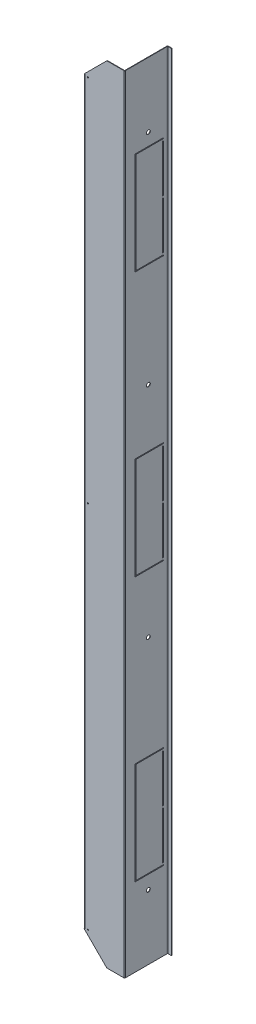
ISO-10303-21;
HEADER;
FILE_DESCRIPTION(('STEP AP214'),'2;1');
FILE_NAME('part.step','',(''),(''),'','','');
FILE_SCHEMA(('AUTOMOTIVE_DESIGN { 1 0 10303 214 1 1 1 1 }'));
ENDSEC;
DATA;
#1=APPLICATION_CONTEXT('core data for automotive mechanical design processes');
#2=APPLICATION_PROTOCOL_DEFINITION('international standard','automotive_design',2000,#1);
#3=PRODUCT_CONTEXT('',#1,'mechanical');
#4=PRODUCT('Part','Part','',(#3));
#5=PRODUCT_RELATED_PRODUCT_CATEGORY('part','',(#4));
#6=PRODUCT_DEFINITION_FORMATION('','',#4);
#7=PRODUCT_DEFINITION_CONTEXT('part definition',#1,'design');
#8=PRODUCT_DEFINITION('design','',#6,#7);
#9=PRODUCT_DEFINITION_SHAPE('','',#8);
#10=(LENGTH_UNIT() NAMED_UNIT(*) SI_UNIT(.MILLI.,.METRE.));
#11=(NAMED_UNIT(*) PLANE_ANGLE_UNIT() SI_UNIT($,.RADIAN.));
#12=(NAMED_UNIT(*) SI_UNIT($,.STERADIAN.) SOLID_ANGLE_UNIT());
#13=UNCERTAINTY_MEASURE_WITH_UNIT(LENGTH_MEASURE(1.E-05),#10,'distance_accuracy_value','');
#14=(GEOMETRIC_REPRESENTATION_CONTEXT(3) GLOBAL_UNCERTAINTY_ASSIGNED_CONTEXT((#13)) GLOBAL_UNIT_ASSIGNED_CONTEXT((#10,
#11,#12)) REPRESENTATION_CONTEXT('',''));
#15=CARTESIAN_POINT('',(0.,0.,0.));
#16=DIRECTION('',(0.,0.,1.));
#17=DIRECTION('',(1.,0.,0.));
#18=AXIS2_PLACEMENT_3D('',#15,#16,#17);
#19=CARTESIAN_POINT('',(502.5,-1019.,-112.600000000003));
#20=DIRECTION('',(0.,1.,0.));
#21=DIRECTION('',(0.,0.,1.));
#22=AXIS2_PLACEMENT_3D('',#19,#20,#21);
#23=PLANE('',#22);
#24=DIRECTION('',(-1.,0.,0.));
#25=VECTOR('',#24,1.);
#26=CARTESIAN_POINT('',(502.5,-1019.,-110.400000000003));
#27=LINE('',#26,#25);
#28=CARTESIAN_POINT('',(502.5,-1019.,-110.400000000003));
#29=VERTEX_POINT('',#28);
#30=CARTESIAN_POINT('',(501.3,-1019.,-110.400000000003));
#31=VERTEX_POINT('',#30);
#32=EDGE_CURVE('E994',#29,#31,#27,.T.);
#33=ORIENTED_EDGE('',*,*,#32,.F.);
#34=DIRECTION('',(0.,0.,-1.));
#35=VECTOR('',#34,1.);
#36=CARTESIAN_POINT('',(502.5,-1019.,2.00737494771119E-12));
#37=LINE('',#36,#35);
#38=CARTESIAN_POINT('',(502.5,-1019.,-2.19999999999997));
#39=VERTEX_POINT('',#38);
#40=EDGE_CURVE('E1003',#39,#29,#37,.T.);
#41=ORIENTED_EDGE('',*,*,#40,.F.);
#42=DIRECTION('',(-1.,0.,0.));
#43=VECTOR('',#42,1.);
#44=CARTESIAN_POINT('',(501.3,-1019.,-2.19999999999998));
#45=LINE('',#44,#43);
#46=CARTESIAN_POINT('',(501.3,-1019.,-2.19999999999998));
#47=VERTEX_POINT('',#46);
#48=EDGE_CURVE('E1014',#47,#39,#45,.F.);
#49=ORIENTED_EDGE('',*,*,#48,.F.);
#50=DIRECTION('',(0.,0.,1.));
#51=VECTOR('',#50,1.);
#52=CARTESIAN_POINT('',(501.3,-1019.,-112.600000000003));
#53=LINE('',#52,#51);
#54=EDGE_CURVE('E1008',#47,#31,#53,.F.);
#55=ORIENTED_EDGE('',*,*,#54,.T.);
#56=EDGE_LOOP('',(#33,#41,#49,#55));
#57=FACE_BOUND('',#56,.T.);
#58=ADVANCED_FACE('F103',(#57),#23,.F.);
#59=CARTESIAN_POINT('',(502.5,1019.,-1.2));
#60=DIRECTION('',(0.,-1.,0.));
#61=DIRECTION('',(0.,0.,-1.));
#62=AXIS2_PLACEMENT_3D('',#59,#60,#61);
#63=PLANE('',#62);
#64=DIRECTION('',(-1.,0.,0.));
#65=VECTOR('',#64,1.);
#66=CARTESIAN_POINT('',(502.5,1019.,-110.400000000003));
#67=LINE('',#66,#65);
#68=CARTESIAN_POINT('',(502.5,1019.,-110.400000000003));
#69=VERTEX_POINT('',#68);
#70=CARTESIAN_POINT('',(501.3,1019.,-110.400000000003));
#71=VERTEX_POINT('',#70);
#72=EDGE_CURVE('E984',#69,#71,#67,.T.);
#73=ORIENTED_EDGE('',*,*,#72,.T.);
#74=DIRECTION('',(0.,0.,-1.));
#75=VECTOR('',#74,1.);
#76=CARTESIAN_POINT('',(501.3,1019.,-1.2));
#77=LINE('',#76,#75);
#78=CARTESIAN_POINT('',(501.3,1019.,-2.19999999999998));
#79=VERTEX_POINT('',#78);
#80=EDGE_CURVE('E1006',#71,#79,#77,.F.);
#81=ORIENTED_EDGE('',*,*,#80,.T.);
#82=DIRECTION('',(-1.,0.,0.));
#83=VECTOR('',#82,1.);
#84=CARTESIAN_POINT('',(502.5,1019.,-2.19999999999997));
#85=LINE('',#84,#83);
#86=CARTESIAN_POINT('',(502.5,1019.,-2.19999999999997));
#87=VERTEX_POINT('',#86);
#88=EDGE_CURVE('E997',#79,#87,#85,.F.);
#89=ORIENTED_EDGE('',*,*,#88,.T.);
#90=DIRECTION('',(0.,0.,1.));
#91=VECTOR('',#90,1.);
#92=CARTESIAN_POINT('',(502.5,1019.,-6.11698600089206E-12));
#93=LINE('',#92,#91);
#94=EDGE_CURVE('E1000',#69,#87,#93,.T.);
#95=ORIENTED_EDGE('',*,*,#94,.F.);
#96=EDGE_LOOP('',(#73,#81,#89,#95));
#97=FACE_BOUND('',#96,.T.);
#98=ADVANCED_FACE('F1192',(#97),#63,.F.);
#99=CARTESIAN_POINT('',(502.5,0.,2.00737494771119E-12));
#100=DIRECTION('',(-1.,0.,0.));
#101=DIRECTION('',(0.,0.,1.));
#102=AXIS2_PLACEMENT_3D('',#99,#100,#101);
#103=PLANE('',#102);
#104=CARTESIAN_POINT('',(502.5,851.,-61.4999999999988));
#105=DIRECTION('',(1.,0.,0.));
#106=DIRECTION('',(0.,0.,-1.));
#107=AXIS2_PLACEMENT_3D('',#104,#105,#106);
#108=CIRCLE('',#107,5.00000000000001);
#109=CARTESIAN_POINT('',(502.5,851.,-66.4999999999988));
#110=VERTEX_POINT('',#109);
#111=EDGE_CURVE('E584',#110,#110,#108,.T.);
#112=ORIENTED_EDGE('',*,*,#111,.F.);
#113=EDGE_LOOP('',(#112));
#114=FACE_BOUND('',#113,.T.);
#115=CARTESIAN_POINT('',(502.5,283.666666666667,-61.4999999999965));
#116=DIRECTION('',(1.,0.,0.));
#117=DIRECTION('',(0.,0.,-1.));
#118=AXIS2_PLACEMENT_3D('',#115,#116,#117);
#119=CIRCLE('',#118,5.00000000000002);
#120=CARTESIAN_POINT('',(502.5,283.666666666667,-66.4999999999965));
#121=VERTEX_POINT('',#120);
#122=EDGE_CURVE('E2413',#121,#121,#119,.T.);
#123=ORIENTED_EDGE('',*,*,#122,.F.);
#124=EDGE_LOOP('',(#123));
#125=FACE_BOUND('',#124,.T.);
#126=CARTESIAN_POINT('',(502.5,-283.666666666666,-61.4999999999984));
#127=DIRECTION('',(1.,0.,0.));
#128=DIRECTION('',(0.,0.,-1.));
#129=AXIS2_PLACEMENT_3D('',#126,#127,#128);
#130=CIRCLE('',#129,5.00000000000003);
#131=CARTESIAN_POINT('',(502.5,-283.666666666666,-66.4999999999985));
#132=VERTEX_POINT('',#131);
#133=EDGE_CURVE('E2421',#132,#132,#130,.T.);
#134=ORIENTED_EDGE('',*,*,#133,.F.);
#135=EDGE_LOOP('',(#134));
#136=FACE_BOUND('',#135,.T.);
#137=CARTESIAN_POINT('',(502.5,-850.999999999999,-61.5000000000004));
#138=DIRECTION('',(1.,0.,0.));
#139=DIRECTION('',(0.,0.,-1.));
#140=AXIS2_PLACEMENT_3D('',#137,#138,#139);
#141=CIRCLE('',#140,5.00000000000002);
#142=CARTESIAN_POINT('',(502.5,-850.999999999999,-66.5000000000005));
#143=VERTEX_POINT('',#142);
#144=EDGE_CURVE('E2427',#143,#143,#141,.T.);
#145=ORIENTED_EDGE('',*,*,#144,.F.);
#146=EDGE_LOOP('',(#145));
#147=FACE_BOUND('',#146,.T.);
#148=DIRECTION('',(0.,0.,-1.));
#149=VECTOR('',#148,1.);
#150=CARTESIAN_POINT('',(502.5,689.,-98.4000000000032));
#151=LINE('',#150,#149);
#152=CARTESIAN_POINT('',(502.5,689.,-98.4000000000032));
#153=VERTEX_POINT('',#152);
#154=CARTESIAN_POINT('',(502.5,689.,-100.400000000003));
#155=VERTEX_POINT('',#154);
#156=EDGE_CURVE('E720',#153,#155,#151,.T.);
#157=ORIENTED_EDGE('',*,*,#156,.F.);
#158=DIRECTION('',(0.,-1.,0.));
#159=VECTOR('',#158,1.);
#160=CARTESIAN_POINT('',(502.5,812.,-98.4000000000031));
#161=LINE('',#160,#159);
#162=CARTESIAN_POINT('',(502.5,812.,-98.4000000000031));
#163=VERTEX_POINT('',#162);
#164=EDGE_CURVE('E120',#163,#153,#161,.T.);
#165=ORIENTED_EDGE('',*,*,#164,.F.);
#166=DIRECTION('',(0.,0.,1.));
#167=VECTOR('',#166,1.);
#168=CARTESIAN_POINT('',(502.5,812.,-98.4000000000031));
#169=LINE('',#168,#167);
#170=CARTESIAN_POINT('',(502.5,812.,-100.400000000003));
#171=VERTEX_POINT('',#170);
#172=EDGE_CURVE('E726',#171,#163,#169,.T.);
#173=ORIENTED_EDGE('',*,*,#172,.F.);
#174=DIRECTION('',(0.,1.,0.));
#175=VECTOR('',#174,1.);
#176=CARTESIAN_POINT('',(502.5,812.,-100.400000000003));
#177=LINE('',#176,#175);
#178=EDGE_CURVE('E723',#155,#171,#177,.T.);
#179=ORIENTED_EDGE('',*,*,#178,.F.);
#180=EDGE_LOOP('',(#157,#165,#173,#179));
#181=FACE_BOUND('',#180,.T.);
#182=DIRECTION('',(0.,0.,-1.));
#183=VECTOR('',#182,1.);
#184=CARTESIAN_POINT('',(502.5,561.,-98.4000000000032));
#185=LINE('',#184,#183);
#186=CARTESIAN_POINT('',(502.5,561.,-98.4000000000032));
#187=VERTEX_POINT('',#186);
#188=CARTESIAN_POINT('',(502.5,561.,-100.400000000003));
#189=VERTEX_POINT('',#188);
#190=EDGE_CURVE('E752',#187,#189,#185,.T.);
#191=ORIENTED_EDGE('',*,*,#190,.F.);
#192=DIRECTION('',(0.,-1.,0.));
#193=VECTOR('',#192,1.);
#194=CARTESIAN_POINT('',(502.5,684.,-98.4000000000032));
#195=LINE('',#194,#193);
#196=CARTESIAN_POINT('',(502.5,684.,-98.4000000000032));
#197=VERTEX_POINT('',#196);
#198=EDGE_CURVE('E128',#197,#187,#195,.T.);
#199=ORIENTED_EDGE('',*,*,#198,.F.);
#200=DIRECTION('',(0.,0.,1.));
#201=VECTOR('',#200,1.);
#202=CARTESIAN_POINT('',(502.5,684.,-98.4000000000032));
#203=LINE('',#202,#201);
#204=CARTESIAN_POINT('',(502.5,684.,-100.400000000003));
#205=VERTEX_POINT('',#204);
#206=EDGE_CURVE('E758',#205,#197,#203,.T.);
#207=ORIENTED_EDGE('',*,*,#206,.F.);
#208=DIRECTION('',(0.,1.,0.));
#209=VECTOR('',#208,1.);
#210=CARTESIAN_POINT('',(502.5,684.,-100.400000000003));
#211=LINE('',#210,#209);
#212=EDGE_CURVE('E755',#189,#205,#211,.T.);
#213=ORIENTED_EDGE('',*,*,#212,.F.);
#214=EDGE_LOOP('',(#191,#199,#207,#213));
#215=FACE_BOUND('',#214,.T.);
#216=DIRECTION('',(0.,0.,-1.));
#217=VECTOR('',#216,1.);
#218=CARTESIAN_POINT('',(502.5,3.99999999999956,-98.4000000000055));
#219=LINE('',#218,#217);
#220=CARTESIAN_POINT('',(502.5,3.99999999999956,-98.4000000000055));
#221=VERTEX_POINT('',#220);
#222=CARTESIAN_POINT('',(502.5,3.99999999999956,-100.400000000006));
#223=VERTEX_POINT('',#222);
#224=EDGE_CURVE('E781',#221,#223,#219,.T.);
#225=ORIENTED_EDGE('',*,*,#224,.F.);
#226=DIRECTION('',(0.,-1.,0.));
#227=VECTOR('',#226,1.);
#228=CARTESIAN_POINT('',(502.5,127.,-98.4000000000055));
#229=LINE('',#228,#227);
#230=CARTESIAN_POINT('',(502.5,127.,-98.4000000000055));
#231=VERTEX_POINT('',#230);
#232=EDGE_CURVE('E779',#231,#221,#229,.T.);
#233=ORIENTED_EDGE('',*,*,#232,.F.);
#234=DIRECTION('',(0.,0.,1.));
#235=VECTOR('',#234,1.);
#236=CARTESIAN_POINT('',(502.5,127.,-98.4000000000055));
#237=LINE('',#236,#235);
#238=CARTESIAN_POINT('',(502.5,127.,-100.400000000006));
#239=VERTEX_POINT('',#238);
#240=EDGE_CURVE('E787',#239,#231,#237,.T.);
#241=ORIENTED_EDGE('',*,*,#240,.F.);
#242=DIRECTION('',(0.,1.,0.));
#243=VECTOR('',#242,1.);
#244=CARTESIAN_POINT('',(502.5,127.,-100.400000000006));
#245=LINE('',#244,#243);
#246=EDGE_CURVE('E784',#223,#239,#245,.T.);
#247=ORIENTED_EDGE('',*,*,#246,.F.);
#248=EDGE_LOOP('',(#225,#233,#241,#247));
#249=FACE_BOUND('',#248,.T.);
#250=DIRECTION('',(0.,0.,1.));
#251=VECTOR('',#250,1.);
#252=CARTESIAN_POINT('',(502.5,134.,-27.2000000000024));
#253=LINE('',#252,#251);
#254=CARTESIAN_POINT('',(502.5,134.,-100.400000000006));
#255=VERTEX_POINT('',#254);
#256=CARTESIAN_POINT('',(502.5,134.,-27.2000000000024));
#257=VERTEX_POINT('',#256);
#258=EDGE_CURVE('E825',#255,#257,#253,.T.);
#259=ORIENTED_EDGE('',*,*,#258,.F.);
#260=DIRECTION('',(0.,1.,0.));
#261=VECTOR('',#260,1.);
#262=CARTESIAN_POINT('',(502.5,132.,-100.400000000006));
#263=LINE('',#262,#261);
#264=CARTESIAN_POINT('',(502.5,132.,-100.400000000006));
#265=VERTEX_POINT('',#264);
#266=EDGE_CURVE('E823',#265,#255,#263,.T.);
#267=ORIENTED_EDGE('',*,*,#266,.F.);
#268=DIRECTION('',(0.,0.,-1.));
#269=VECTOR('',#268,1.);
#270=CARTESIAN_POINT('',(502.5,132.,-29.2000000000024));
#271=LINE('',#270,#269);
#272=CARTESIAN_POINT('',(502.5,132.,-29.2000000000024));
#273=VERTEX_POINT('',#272);
#274=EDGE_CURVE('E843',#273,#265,#271,.T.);
#275=ORIENTED_EDGE('',*,*,#274,.F.);
#276=DIRECTION('',(0.,1.,0.));
#277=VECTOR('',#276,1.);
#278=CARTESIAN_POINT('',(502.5,132.,-29.2000000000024));
#279=LINE('',#278,#277);
#280=CARTESIAN_POINT('',(502.5,-129.,-29.2000000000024));
#281=VERTEX_POINT('',#280);
#282=EDGE_CURVE('E840',#281,#273,#279,.T.);
#283=ORIENTED_EDGE('',*,*,#282,.F.);
#284=DIRECTION('',(0.,0.,1.));
#285=VECTOR('',#284,1.);
#286=CARTESIAN_POINT('',(502.5,-129.,-29.2000000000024));
#287=LINE('',#286,#285);
#288=CARTESIAN_POINT('',(502.5,-129.,-100.400000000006));
#289=VERTEX_POINT('',#288);
#290=EDGE_CURVE('E837',#289,#281,#287,.T.);
#291=ORIENTED_EDGE('',*,*,#290,.F.);
#292=DIRECTION('',(0.,1.,0.));
#293=VECTOR('',#292,1.);
#294=CARTESIAN_POINT('',(502.5,-129.,-100.400000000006));
#295=LINE('',#294,#293);
#296=CARTESIAN_POINT('',(502.5,-131.,-100.400000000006));
#297=VERTEX_POINT('',#296);
#298=EDGE_CURVE('E834',#297,#289,#295,.T.);
#299=ORIENTED_EDGE('',*,*,#298,.F.);
#300=DIRECTION('',(0.,0.,-1.));
#301=VECTOR('',#300,1.);
#302=CARTESIAN_POINT('',(502.5,-131.,-27.2000000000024));
#303=LINE('',#302,#301);
#304=CARTESIAN_POINT('',(502.5,-131.,-27.2000000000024));
#305=VERTEX_POINT('',#304);
#306=EDGE_CURVE('E831',#305,#297,#303,.T.);
#307=ORIENTED_EDGE('',*,*,#306,.F.);
#308=DIRECTION('',(0.,-1.,0.));
#309=VECTOR('',#308,1.);
#310=CARTESIAN_POINT('',(502.5,134.,-27.2000000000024));
#311=LINE('',#310,#309);
#312=EDGE_CURVE('E828',#257,#305,#311,.T.);
#313=ORIENTED_EDGE('',*,*,#312,.F.);
#314=EDGE_LOOP('',(#259,#267,#275,#283,#291,#299,#307,#313));
#315=FACE_BOUND('',#314,.T.);
#316=DIRECTION('',(0.,0.,-1.));
#317=VECTOR('',#316,1.);
#318=CARTESIAN_POINT('',(502.5,-809.,-98.400000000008));
#319=LINE('',#318,#317);
#320=CARTESIAN_POINT('',(502.5,-809.,-98.400000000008));
#321=VERTEX_POINT('',#320);
#322=CARTESIAN_POINT('',(502.5,-809.,-100.400000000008));
#323=VERTEX_POINT('',#322);
#324=EDGE_CURVE('E592',#321,#323,#319,.T.);
#325=ORIENTED_EDGE('',*,*,#324,.F.);
#326=DIRECTION('',(0.,-1.,0.));
#327=VECTOR('',#326,1.);
#328=CARTESIAN_POINT('',(502.5,-686.,-98.4000000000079));
#329=LINE('',#328,#327);
#330=CARTESIAN_POINT('',(502.5,-686.,-98.4000000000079));
#331=VERTEX_POINT('',#330);
#332=EDGE_CURVE('E590',#331,#321,#329,.T.);
#333=ORIENTED_EDGE('',*,*,#332,.F.);
#334=DIRECTION('',(0.,0.,1.));
#335=VECTOR('',#334,1.);
#336=CARTESIAN_POINT('',(502.5,-686.,-98.4000000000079));
#337=LINE('',#336,#335);
#338=CARTESIAN_POINT('',(502.5,-686.,-100.400000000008));
#339=VERTEX_POINT('',#338);
#340=EDGE_CURVE('E598',#339,#331,#337,.T.);
#341=ORIENTED_EDGE('',*,*,#340,.F.);
#342=DIRECTION('',(0.,1.,0.));
#343=VECTOR('',#342,1.);
#344=CARTESIAN_POINT('',(502.5,-686.,-100.400000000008));
#345=LINE('',#344,#343);
#346=EDGE_CURVE('E595',#323,#339,#345,.T.);
#347=ORIENTED_EDGE('',*,*,#346,.F.);
#348=EDGE_LOOP('',(#325,#333,#341,#347));
#349=FACE_BOUND('',#348,.T.);
#350=DIRECTION('',(0.,0.,-1.));
#351=VECTOR('',#350,1.);
#352=CARTESIAN_POINT('',(502.5,-681.,-98.4000000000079));
#353=LINE('',#352,#351);
#354=CARTESIAN_POINT('',(502.5,-681.,-98.4000000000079));
#355=VERTEX_POINT('',#354);
#356=CARTESIAN_POINT('',(502.5,-681.,-100.400000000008));
#357=VERTEX_POINT('',#356);
#358=EDGE_CURVE('E564',#355,#357,#353,.T.);
#359=ORIENTED_EDGE('',*,*,#358,.F.);
#360=DIRECTION('',(0.,-1.,0.));
#361=VECTOR('',#360,1.);
#362=CARTESIAN_POINT('',(502.5,-558.,-98.4000000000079));
#363=LINE('',#362,#361);
#364=CARTESIAN_POINT('',(502.5,-558.,-98.4000000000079));
#365=VERTEX_POINT('',#364);
#366=EDGE_CURVE('E556',#365,#355,#363,.T.);
#367=ORIENTED_EDGE('',*,*,#366,.F.);
#368=DIRECTION('',(0.,0.,1.));
#369=VECTOR('',#368,1.);
#370=CARTESIAN_POINT('',(502.5,-558.,-98.4000000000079));
#371=LINE('',#370,#369);
#372=CARTESIAN_POINT('',(502.5,-558.,-100.400000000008));
#373=VERTEX_POINT('',#372);
#374=EDGE_CURVE('E557',#373,#365,#371,.T.);
#375=ORIENTED_EDGE('',*,*,#374,.F.);
#376=DIRECTION('',(0.,1.,0.));
#377=VECTOR('',#376,1.);
#378=CARTESIAN_POINT('',(502.5,-558.,-100.400000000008));
#379=LINE('',#378,#377);
#380=EDGE_CURVE('E571',#357,#373,#379,.T.);
#381=ORIENTED_EDGE('',*,*,#380,.F.);
#382=EDGE_LOOP('',(#359,#367,#375,#381));
#383=FACE_BOUND('',#382,.T.);
#384=DIRECTION('',(0.,0.,1.));
#385=VECTOR('',#384,1.);
#386=CARTESIAN_POINT('',(502.5,-551.,-27.2000000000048));
#387=LINE('',#386,#385);
#388=CARTESIAN_POINT('',(502.5,-551.,-100.400000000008));
#389=VERTEX_POINT('',#388);
#390=CARTESIAN_POINT('',(502.5,-551.,-27.2000000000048));
#391=VERTEX_POINT('',#390);
#392=EDGE_CURVE('E669',#389,#391,#387,.T.);
#393=ORIENTED_EDGE('',*,*,#392,.F.);
#394=DIRECTION('',(0.,1.,0.));
#395=VECTOR('',#394,1.);
#396=CARTESIAN_POINT('',(502.5,-553.,-100.400000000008));
#397=LINE('',#396,#395);
#398=CARTESIAN_POINT('',(502.5,-553.,-100.400000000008));
#399=VERTEX_POINT('',#398);
#400=EDGE_CURVE('E667',#399,#389,#397,.T.);
#401=ORIENTED_EDGE('',*,*,#400,.F.);
#402=DIRECTION('',(0.,0.,-1.));
#403=VECTOR('',#402,1.);
#404=CARTESIAN_POINT('',(502.5,-553.,-29.2000000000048));
#405=LINE('',#404,#403);
#406=CARTESIAN_POINT('',(502.5,-553.,-29.2000000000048));
#407=VERTEX_POINT('',#406);
#408=EDGE_CURVE('E687',#407,#399,#405,.T.);
#409=ORIENTED_EDGE('',*,*,#408,.F.);
#410=DIRECTION('',(0.,1.,0.));
#411=VECTOR('',#410,1.);
#412=CARTESIAN_POINT('',(502.5,-553.,-29.2000000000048));
#413=LINE('',#412,#411);
#414=CARTESIAN_POINT('',(502.5,-814.,-29.2000000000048));
#415=VERTEX_POINT('',#414);
#416=EDGE_CURVE('E684',#415,#407,#413,.T.);
#417=ORIENTED_EDGE('',*,*,#416,.F.);
#418=DIRECTION('',(0.,0.,1.));
#419=VECTOR('',#418,1.);
#420=CARTESIAN_POINT('',(502.5,-814.,-29.2000000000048));
#421=LINE('',#420,#419);
#422=CARTESIAN_POINT('',(502.5,-814.,-100.400000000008));
#423=VERTEX_POINT('',#422);
#424=EDGE_CURVE('E681',#423,#415,#421,.T.);
#425=ORIENTED_EDGE('',*,*,#424,.F.);
#426=DIRECTION('',(0.,1.,0.));
#427=VECTOR('',#426,1.);
#428=CARTESIAN_POINT('',(502.5,-814.,-100.400000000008));
#429=LINE('',#428,#427);
#430=CARTESIAN_POINT('',(502.5,-816.,-100.400000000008));
#431=VERTEX_POINT('',#430);
#432=EDGE_CURVE('E678',#431,#423,#429,.T.);
#433=ORIENTED_EDGE('',*,*,#432,.F.);
#434=DIRECTION('',(0.,0.,-1.));
#435=VECTOR('',#434,1.);
#436=CARTESIAN_POINT('',(502.5,-816.,-27.2000000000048));
#437=LINE('',#436,#435);
#438=CARTESIAN_POINT('',(502.5,-816.,-27.2000000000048));
#439=VERTEX_POINT('',#438);
#440=EDGE_CURVE('E675',#439,#431,#437,.T.);
#441=ORIENTED_EDGE('',*,*,#440,.F.);
#442=DIRECTION('',(0.,-1.,0.));
#443=VECTOR('',#442,1.);
#444=CARTESIAN_POINT('',(502.5,-551.,-27.2000000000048));
#445=LINE('',#444,#443);
#446=EDGE_CURVE('E672',#391,#439,#445,.T.);
#447=ORIENTED_EDGE('',*,*,#446,.F.);
#448=EDGE_LOOP('',(#393,#401,#409,#417,#425,#433,#441,#447));
#449=FACE_BOUND('',#448,.T.);
#450=DIRECTION('',(0.,0.,-1.));
#451=VECTOR('',#450,1.);
#452=CARTESIAN_POINT('',(502.5,-124.,-98.4000000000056));
#453=LINE('',#452,#451);
#454=CARTESIAN_POINT('',(502.5,-124.,-98.4000000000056));
#455=VERTEX_POINT('',#454);
#456=CARTESIAN_POINT('',(502.5,-124.,-100.400000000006));
#457=VERTEX_POINT('',#456);
#458=EDGE_CURVE('E625',#455,#457,#453,.T.);
#459=ORIENTED_EDGE('',*,*,#458,.F.);
#460=DIRECTION('',(0.,-1.,0.));
#461=VECTOR('',#460,1.);
#462=CARTESIAN_POINT('',(502.5,-1.00000000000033,-98.4000000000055));
#463=LINE('',#462,#461);
#464=CARTESIAN_POINT('',(502.5,-1.00000000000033,-98.4000000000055));
#465=VERTEX_POINT('',#464);
#466=EDGE_CURVE('E623',#465,#455,#463,.T.);
#467=ORIENTED_EDGE('',*,*,#466,.F.);
#468=DIRECTION('',(0.,0.,1.));
#469=VECTOR('',#468,1.);
#470=CARTESIAN_POINT('',(502.5,-1.00000000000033,-98.4000000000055));
#471=LINE('',#470,#469);
#472=CARTESIAN_POINT('',(502.5,-1.00000000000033,-100.400000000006));
#473=VERTEX_POINT('',#472);
#474=EDGE_CURVE('E631',#473,#465,#471,.T.);
#475=ORIENTED_EDGE('',*,*,#474,.F.);
#476=DIRECTION('',(0.,1.,0.));
#477=VECTOR('',#476,1.);
#478=CARTESIAN_POINT('',(502.5,-1.00000000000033,-100.400000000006));
#479=LINE('',#478,#477);
#480=EDGE_CURVE('E628',#457,#473,#479,.T.);
#481=ORIENTED_EDGE('',*,*,#480,.F.);
#482=EDGE_LOOP('',(#459,#467,#475,#481));
#483=FACE_BOUND('',#482,.T.);
#484=DIRECTION('',(0.,0.,1.));
#485=VECTOR('',#484,1.);
#486=CARTESIAN_POINT('',(502.5,819.,-27.2));
#487=LINE('',#486,#485);
#488=CARTESIAN_POINT('',(502.5,819.,-100.400000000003));
#489=VERTEX_POINT('',#488);
#490=CARTESIAN_POINT('',(502.5,819.,-27.2));
#491=VERTEX_POINT('',#490);
#492=EDGE_CURVE('E887',#489,#491,#487,.T.);
#493=ORIENTED_EDGE('',*,*,#492,.F.);
#494=DIRECTION('',(0.,1.,0.));
#495=VECTOR('',#494,1.);
#496=CARTESIAN_POINT('',(502.5,817.,-100.400000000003));
#497=LINE('',#496,#495);
#498=CARTESIAN_POINT('',(502.5,817.,-100.400000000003));
#499=VERTEX_POINT('',#498);
#500=EDGE_CURVE('E885',#499,#489,#497,.T.);
#501=ORIENTED_EDGE('',*,*,#500,.F.);
#502=DIRECTION('',(0.,0.,-1.));
#503=VECTOR('',#502,1.);
#504=CARTESIAN_POINT('',(502.5,817.,-29.2));
#505=LINE('',#504,#503);
#506=CARTESIAN_POINT('',(502.5,817.,-29.2));
#507=VERTEX_POINT('',#506);
#508=EDGE_CURVE('E905',#507,#499,#505,.T.);
#509=ORIENTED_EDGE('',*,*,#508,.F.);
#510=DIRECTION('',(0.,1.,0.));
#511=VECTOR('',#510,1.);
#512=CARTESIAN_POINT('',(502.5,817.,-29.2));
#513=LINE('',#512,#511);
#514=CARTESIAN_POINT('',(502.5,556.,-29.2));
#515=VERTEX_POINT('',#514);
#516=EDGE_CURVE('E902',#515,#507,#513,.T.);
#517=ORIENTED_EDGE('',*,*,#516,.F.);
#518=DIRECTION('',(0.,0.,1.));
#519=VECTOR('',#518,1.);
#520=CARTESIAN_POINT('',(502.5,556.,-29.2));
#521=LINE('',#520,#519);
#522=CARTESIAN_POINT('',(502.5,556.,-100.400000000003));
#523=VERTEX_POINT('',#522);
#524=EDGE_CURVE('E899',#523,#515,#521,.T.);
#525=ORIENTED_EDGE('',*,*,#524,.F.);
#526=DIRECTION('',(0.,1.,0.));
#527=VECTOR('',#526,1.);
#528=CARTESIAN_POINT('',(502.5,556.,-100.400000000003));
#529=LINE('',#528,#527);
#530=CARTESIAN_POINT('',(502.5,554.,-100.400000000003));
#531=VERTEX_POINT('',#530);
#532=EDGE_CURVE('E896',#531,#523,#529,.T.);
#533=ORIENTED_EDGE('',*,*,#532,.F.);
#534=DIRECTION('',(0.,0.,-1.));
#535=VECTOR('',#534,1.);
#536=CARTESIAN_POINT('',(502.5,554.,-27.2));
#537=LINE('',#536,#535);
#538=CARTESIAN_POINT('',(502.5,554.,-27.2));
#539=VERTEX_POINT('',#538);
#540=EDGE_CURVE('E893',#539,#531,#537,.T.);
#541=ORIENTED_EDGE('',*,*,#540,.F.);
#542=DIRECTION('',(0.,-1.,0.));
#543=VECTOR('',#542,1.);
#544=CARTESIAN_POINT('',(502.5,819.,-27.2));
#545=LINE('',#544,#543);
#546=EDGE_CURVE('E890',#491,#539,#545,.T.);
#547=ORIENTED_EDGE('',*,*,#546,.F.);
#548=EDGE_LOOP('',(#493,#501,#509,#517,#525,#533,#541,#547));
#549=FACE_BOUND('',#548,.T.);
#550=DIRECTION('',(0.,1.,0.));
#551=VECTOR('',#550,1.);
#552=CARTESIAN_POINT('',(502.5,1019.,-110.400000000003));
#553=LINE('',#552,#551);
#554=EDGE_CURVE('E990',#69,#29,#553,.F.);
#555=ORIENTED_EDGE('',*,*,#554,.F.);
#556=ORIENTED_EDGE('',*,*,#94,.T.);
#557=DIRECTION('',(0.,-1.,0.));
#558=VECTOR('',#557,1.);
#559=CARTESIAN_POINT('',(502.5,1019.,-2.19999999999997));
#560=LINE('',#559,#558);
#561=EDGE_CURVE('E1011',#39,#87,#560,.F.);
#562=ORIENTED_EDGE('',*,*,#561,.F.);
#563=ORIENTED_EDGE('',*,*,#40,.T.);
#564=EDGE_LOOP('',(#555,#556,#562,#563));
#565=FACE_BOUND('',#564,.T.);
#566=ADVANCED_FACE('F1198',(#114,#125,#136,#147,#181,#215,#249,#315,#349,#383,#449,#483,#549,
#565),#103,.F.);
#567=CARTESIAN_POINT('',(501.3,0.,2.00318517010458E-12));
#568=DIRECTION('',(-1.,0.,0.));
#569=DIRECTION('',(0.,0.,1.));
#570=AXIS2_PLACEMENT_3D('',#567,#568,#569);
#571=PLANE('',#570);
#572=CARTESIAN_POINT('',(501.3,851.,-61.4999999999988));
#573=DIRECTION('',(-1.,0.,0.));
#574=DIRECTION('',(0.,0.,1.));
#575=AXIS2_PLACEMENT_3D('',#572,#573,#574);
#576=CIRCLE('',#575,5.00000000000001);
#577=CARTESIAN_POINT('',(501.3,851.,-56.4999999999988));
#578=VERTEX_POINT('',#577);
#579=EDGE_CURVE('E2409',#578,#578,#576,.F.);
#580=ORIENTED_EDGE('',*,*,#579,.T.);
#581=EDGE_LOOP('',(#580));
#582=FACE_BOUND('',#581,.T.);
#583=CARTESIAN_POINT('',(501.3,283.666666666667,-61.4999999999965));
#584=DIRECTION('',(-1.,0.,0.));
#585=DIRECTION('',(0.,0.,1.));
#586=AXIS2_PLACEMENT_3D('',#583,#584,#585);
#587=CIRCLE('',#586,5.00000000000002);
#588=CARTESIAN_POINT('',(501.3,283.666666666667,-56.4999999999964));
#589=VERTEX_POINT('',#588);
#590=EDGE_CURVE('E2418',#589,#589,#587,.F.);
#591=ORIENTED_EDGE('',*,*,#590,.T.);
#592=EDGE_LOOP('',(#591));
#593=FACE_BOUND('',#592,.T.);
#594=CARTESIAN_POINT('',(501.3,-283.666666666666,-61.4999999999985));
#595=DIRECTION('',(-1.,0.,0.));
#596=DIRECTION('',(0.,0.,1.));
#597=AXIS2_PLACEMENT_3D('',#594,#595,#596);
#598=CIRCLE('',#597,5.00000000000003);
#599=CARTESIAN_POINT('',(501.3,-283.666666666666,-56.4999999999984));
#600=VERTEX_POINT('',#599);
#601=EDGE_CURVE('E2424',#600,#600,#598,.F.);
#602=ORIENTED_EDGE('',*,*,#601,.T.);
#603=EDGE_LOOP('',(#602));
#604=FACE_BOUND('',#603,.T.);
#605=CARTESIAN_POINT('',(501.3,-850.999999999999,-61.5000000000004));
#606=DIRECTION('',(-1.,0.,0.));
#607=DIRECTION('',(0.,0.,1.));
#608=AXIS2_PLACEMENT_3D('',#605,#606,#607);
#609=CIRCLE('',#608,5.00000000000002);
#610=CARTESIAN_POINT('',(501.3,-850.999999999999,-56.5000000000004));
#611=VERTEX_POINT('',#610);
#612=EDGE_CURVE('E2430',#611,#611,#609,.F.);
#613=ORIENTED_EDGE('',*,*,#612,.T.);
#614=EDGE_LOOP('',(#613));
#615=FACE_BOUND('',#614,.T.);
#616=DIRECTION('',(0.,-1.,0.));
#617=VECTOR('',#616,1.);
#618=CARTESIAN_POINT('',(501.3,812.,-98.4000000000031));
#619=LINE('',#618,#617);
#620=CARTESIAN_POINT('',(501.3,812.,-98.4000000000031));
#621=VERTEX_POINT('',#620);
#622=CARTESIAN_POINT('',(501.3,689.,-98.4000000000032));
#623=VERTEX_POINT('',#622);
#624=EDGE_CURVE('E716',#621,#623,#619,.T.);
#625=ORIENTED_EDGE('',*,*,#624,.T.);
#626=DIRECTION('',(0.,0.,-1.));
#627=VECTOR('',#626,1.);
#628=CARTESIAN_POINT('',(501.3,689.,-98.4000000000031));
#629=LINE('',#628,#627);
#630=CARTESIAN_POINT('',(501.3,689.,-100.400000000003));
#631=VERTEX_POINT('',#630);
#632=EDGE_CURVE('E732',#623,#631,#629,.T.);
#633=ORIENTED_EDGE('',*,*,#632,.T.);
#634=DIRECTION('',(0.,1.,0.));
#635=VECTOR('',#634,1.);
#636=CARTESIAN_POINT('',(501.3,812.,-100.400000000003));
#637=LINE('',#636,#635);
#638=CARTESIAN_POINT('',(501.3,812.,-100.400000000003));
#639=VERTEX_POINT('',#638);
#640=EDGE_CURVE('E709',#631,#639,#637,.T.);
#641=ORIENTED_EDGE('',*,*,#640,.T.);
#642=DIRECTION('',(0.,0.,1.));
#643=VECTOR('',#642,1.);
#644=CARTESIAN_POINT('',(501.3,812.,-98.4000000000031));
#645=LINE('',#644,#643);
#646=EDGE_CURVE('E712',#639,#621,#645,.T.);
#647=ORIENTED_EDGE('',*,*,#646,.T.);
#648=EDGE_LOOP('',(#625,#633,#641,#647));
#649=FACE_BOUND('',#648,.T.);
#650=DIRECTION('',(0.,-1.,0.));
#651=VECTOR('',#650,1.);
#652=CARTESIAN_POINT('',(501.3,684.,-98.4000000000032));
#653=LINE('',#652,#651);
#654=CARTESIAN_POINT('',(501.3,684.,-98.4000000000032));
#655=VERTEX_POINT('',#654);
#656=CARTESIAN_POINT('',(501.3,561.,-98.4000000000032));
#657=VERTEX_POINT('',#656);
#658=EDGE_CURVE('E748',#655,#657,#653,.T.);
#659=ORIENTED_EDGE('',*,*,#658,.T.);
#660=DIRECTION('',(0.,0.,-1.));
#661=VECTOR('',#660,1.);
#662=CARTESIAN_POINT('',(501.3,561.,-98.4000000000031));
#663=LINE('',#662,#661);
#664=CARTESIAN_POINT('',(501.3,561.,-100.400000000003));
#665=VERTEX_POINT('',#664);
#666=EDGE_CURVE('E713',#657,#665,#663,.T.);
#667=ORIENTED_EDGE('',*,*,#666,.T.);
#668=DIRECTION('',(0.,1.,0.));
#669=VECTOR('',#668,1.);
#670=CARTESIAN_POINT('',(501.3,684.,-100.400000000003));
#671=LINE('',#670,#669);
#672=CARTESIAN_POINT('',(501.3,684.,-100.400000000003));
#673=VERTEX_POINT('',#672);
#674=EDGE_CURVE('E741',#665,#673,#671,.T.);
#675=ORIENTED_EDGE('',*,*,#674,.T.);
#676=DIRECTION('',(0.,0.,1.));
#677=VECTOR('',#676,1.);
#678=CARTESIAN_POINT('',(501.3,684.,-98.4000000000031));
#679=LINE('',#678,#677);
#680=EDGE_CURVE('E744',#673,#655,#679,.T.);
#681=ORIENTED_EDGE('',*,*,#680,.T.);
#682=EDGE_LOOP('',(#659,#667,#675,#681));
#683=FACE_BOUND('',#682,.T.);
#684=DIRECTION('',(0.,-1.,0.));
#685=VECTOR('',#684,1.);
#686=CARTESIAN_POINT('',(501.3,127.,-98.4000000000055));
#687=LINE('',#686,#685);
#688=CARTESIAN_POINT('',(501.3,127.,-98.4000000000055));
#689=VERTEX_POINT('',#688);
#690=CARTESIAN_POINT('',(501.3,3.99999999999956,-98.4000000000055));
#691=VERTEX_POINT('',#690);
#692=EDGE_CURVE('E776',#689,#691,#687,.T.);
#693=ORIENTED_EDGE('',*,*,#692,.T.);
#694=DIRECTION('',(0.,0.,-1.));
#695=VECTOR('',#694,1.);
#696=CARTESIAN_POINT('',(501.3,3.99999999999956,-98.4000000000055));
#697=LINE('',#696,#695);
#698=CARTESIAN_POINT('',(501.3,3.99999999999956,-100.400000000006));
#699=VERTEX_POINT('',#698);
#700=EDGE_CURVE('E793',#691,#699,#697,.T.);
#701=ORIENTED_EDGE('',*,*,#700,.T.);
#702=DIRECTION('',(0.,1.,0.));
#703=VECTOR('',#702,1.);
#704=CARTESIAN_POINT('',(501.3,127.,-100.400000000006));
#705=LINE('',#704,#703);
#706=CARTESIAN_POINT('',(501.3,127.,-100.400000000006));
#707=VERTEX_POINT('',#706);
#708=EDGE_CURVE('E646',#699,#707,#705,.T.);
#709=ORIENTED_EDGE('',*,*,#708,.T.);
#710=DIRECTION('',(0.,0.,1.));
#711=VECTOR('',#710,1.);
#712=CARTESIAN_POINT('',(501.3,127.,-98.4000000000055));
#713=LINE('',#712,#711);
#714=EDGE_CURVE('E773',#707,#689,#713,.T.);
#715=ORIENTED_EDGE('',*,*,#714,.T.);
#716=EDGE_LOOP('',(#693,#701,#709,#715));
#717=FACE_BOUND('',#716,.T.);
#718=DIRECTION('',(0.,1.,0.));
#719=VECTOR('',#718,1.);
#720=CARTESIAN_POINT('',(501.3,132.,-100.400000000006));
#721=LINE('',#720,#719);
#722=CARTESIAN_POINT('',(501.3,132.,-100.400000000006));
#723=VERTEX_POINT('',#722);
#724=CARTESIAN_POINT('',(501.3,134.,-100.400000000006));
#725=VERTEX_POINT('',#724);
#726=EDGE_CURVE('E820',#723,#725,#721,.T.);
#727=ORIENTED_EDGE('',*,*,#726,.T.);
#728=DIRECTION('',(0.,0.,1.));
#729=VECTOR('',#728,1.);
#730=CARTESIAN_POINT('',(501.3,134.,-27.2000000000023));
#731=LINE('',#730,#729);
#732=CARTESIAN_POINT('',(501.3,134.,-27.2000000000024));
#733=VERTEX_POINT('',#732);
#734=EDGE_CURVE('E745',#725,#733,#731,.T.);
#735=ORIENTED_EDGE('',*,*,#734,.T.);
#736=DIRECTION('',(0.,-1.,0.));
#737=VECTOR('',#736,1.);
#738=CARTESIAN_POINT('',(501.3,134.,-27.2000000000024));
#739=LINE('',#738,#737);
#740=CARTESIAN_POINT('',(501.3,-131.000000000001,-27.2000000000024));
#741=VERTEX_POINT('',#740);
#742=EDGE_CURVE('E802',#733,#741,#739,.T.);
#743=ORIENTED_EDGE('',*,*,#742,.T.);
#744=DIRECTION('',(0.,0.,-1.));
#745=VECTOR('',#744,1.);
#746=CARTESIAN_POINT('',(501.3,-131.,-27.2000000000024));
#747=LINE('',#746,#745);
#748=CARTESIAN_POINT('',(501.3,-131.,-100.400000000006));
#749=VERTEX_POINT('',#748);
#750=EDGE_CURVE('E805',#741,#749,#747,.T.);
#751=ORIENTED_EDGE('',*,*,#750,.T.);
#752=DIRECTION('',(0.,1.,0.));
#753=VECTOR('',#752,1.);
#754=CARTESIAN_POINT('',(501.3,-129.,-100.400000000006));
#755=LINE('',#754,#753);
#756=CARTESIAN_POINT('',(501.3,-129.,-100.400000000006));
#757=VERTEX_POINT('',#756);
#758=EDGE_CURVE('E808',#749,#757,#755,.T.);
#759=ORIENTED_EDGE('',*,*,#758,.T.);
#760=DIRECTION('',(0.,0.,1.));
#761=VECTOR('',#760,1.);
#762=CARTESIAN_POINT('',(501.3,-129.,-29.2000000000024));
#763=LINE('',#762,#761);
#764=CARTESIAN_POINT('',(501.3,-129.,-29.2000000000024));
#765=VERTEX_POINT('',#764);
#766=EDGE_CURVE('E811',#757,#765,#763,.T.);
#767=ORIENTED_EDGE('',*,*,#766,.T.);
#768=DIRECTION('',(0.,1.,0.));
#769=VECTOR('',#768,1.);
#770=CARTESIAN_POINT('',(501.3,132.,-29.2000000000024));
#771=LINE('',#770,#769);
#772=CARTESIAN_POINT('',(501.3,132.,-29.2000000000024));
#773=VERTEX_POINT('',#772);
#774=EDGE_CURVE('E814',#765,#773,#771,.T.);
#775=ORIENTED_EDGE('',*,*,#774,.T.);
#776=DIRECTION('',(0.,0.,-1.));
#777=VECTOR('',#776,1.);
#778=CARTESIAN_POINT('',(501.3,132.,-29.2000000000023));
#779=LINE('',#778,#777);
#780=EDGE_CURVE('E817',#773,#723,#779,.T.);
#781=ORIENTED_EDGE('',*,*,#780,.T.);
#782=EDGE_LOOP('',(#727,#735,#743,#751,#759,#767,#775,#781));
#783=FACE_BOUND('',#782,.T.);
#784=DIRECTION('',(0.,-1.,0.));
#785=VECTOR('',#784,1.);
#786=CARTESIAN_POINT('',(501.3,-686.,-98.4000000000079));
#787=LINE('',#786,#785);
#788=CARTESIAN_POINT('',(501.3,-686.,-98.4000000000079));
#789=VERTEX_POINT('',#788);
#790=CARTESIAN_POINT('',(501.3,-809.,-98.400000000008));
#791=VERTEX_POINT('',#790);
#792=EDGE_CURVE('E587',#789,#791,#787,.T.);
#793=ORIENTED_EDGE('',*,*,#792,.T.);
#794=DIRECTION('',(0.,0.,-1.));
#795=VECTOR('',#794,1.);
#796=CARTESIAN_POINT('',(501.3,-809.,-98.4000000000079));
#797=LINE('',#796,#795);
#798=CARTESIAN_POINT('',(501.3,-809.,-100.400000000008));
#799=VERTEX_POINT('',#798);
#800=EDGE_CURVE('E604',#791,#799,#797,.T.);
#801=ORIENTED_EDGE('',*,*,#800,.T.);
#802=DIRECTION('',(0.,1.,0.));
#803=VECTOR('',#802,1.);
#804=CARTESIAN_POINT('',(501.3,-686.,-100.400000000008));
#805=LINE('',#804,#803);
#806=CARTESIAN_POINT('',(501.3,-686.,-100.400000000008));
#807=VERTEX_POINT('',#806);
#808=EDGE_CURVE('E580',#799,#807,#805,.T.);
#809=ORIENTED_EDGE('',*,*,#808,.T.);
#810=DIRECTION('',(0.,0.,1.));
#811=VECTOR('',#810,1.);
#812=CARTESIAN_POINT('',(501.3,-686.,-98.4000000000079));
#813=LINE('',#812,#811);
#814=EDGE_CURVE('E583',#807,#789,#813,.T.);
#815=ORIENTED_EDGE('',*,*,#814,.T.);
#816=EDGE_LOOP('',(#793,#801,#809,#815));
#817=FACE_BOUND('',#816,.T.);
#818=DIRECTION('',(0.,-1.,0.));
#819=VECTOR('',#818,1.);
#820=CARTESIAN_POINT('',(501.3,-558.,-98.4000000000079));
#821=LINE('',#820,#819);
#822=CARTESIAN_POINT('',(501.3,-558.,-98.4000000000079));
#823=VERTEX_POINT('',#822);
#824=CARTESIAN_POINT('',(501.3,-681.,-98.4000000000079));
#825=VERTEX_POINT('',#824);
#826=EDGE_CURVE('E553',#823,#825,#821,.T.);
#827=ORIENTED_EDGE('',*,*,#826,.T.);
#828=DIRECTION('',(0.,0.,-1.));
#829=VECTOR('',#828,1.);
#830=CARTESIAN_POINT('',(501.3,-681.,-98.4000000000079));
#831=LINE('',#830,#829);
#832=CARTESIAN_POINT('',(501.3,-681.,-100.400000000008));
#833=VERTEX_POINT('',#832);
#834=EDGE_CURVE('E537',#825,#833,#831,.T.);
#835=ORIENTED_EDGE('',*,*,#834,.T.);
#836=DIRECTION('',(0.,1.,0.));
#837=VECTOR('',#836,1.);
#838=CARTESIAN_POINT('',(501.3,-558.,-100.400000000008));
#839=LINE('',#838,#837);
#840=CARTESIAN_POINT('',(501.3,-558.,-100.400000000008));
#841=VERTEX_POINT('',#840);
#842=EDGE_CURVE('E566',#833,#841,#839,.T.);
#843=ORIENTED_EDGE('',*,*,#842,.T.);
#844=DIRECTION('',(0.,0.,1.));
#845=VECTOR('',#844,1.);
#846=CARTESIAN_POINT('',(501.3,-558.,-98.4000000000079));
#847=LINE('',#846,#845);
#848=EDGE_CURVE('E562',#841,#823,#847,.T.);
#849=ORIENTED_EDGE('',*,*,#848,.T.);
#850=EDGE_LOOP('',(#827,#835,#843,#849));
#851=FACE_BOUND('',#850,.T.);
#852=DIRECTION('',(0.,1.,0.));
#853=VECTOR('',#852,1.);
#854=CARTESIAN_POINT('',(501.3,-553.,-100.400000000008));
#855=LINE('',#854,#853);
#856=CARTESIAN_POINT('',(501.3,-553.,-100.400000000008));
#857=VERTEX_POINT('',#856);
#858=CARTESIAN_POINT('',(501.3,-551.,-100.400000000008));
#859=VERTEX_POINT('',#858);
#860=EDGE_CURVE('E664',#857,#859,#855,.T.);
#861=ORIENTED_EDGE('',*,*,#860,.T.);
#862=DIRECTION('',(0.,0.,1.));
#863=VECTOR('',#862,1.);
#864=CARTESIAN_POINT('',(501.3,-551.,-27.2000000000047));
#865=LINE('',#864,#863);
#866=CARTESIAN_POINT('',(501.3,-551.,-27.2000000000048));
#867=VERTEX_POINT('',#866);
#868=EDGE_CURVE('E617',#859,#867,#865,.T.);
#869=ORIENTED_EDGE('',*,*,#868,.T.);
#870=DIRECTION('',(0.,-1.,0.));
#871=VECTOR('',#870,1.);
#872=CARTESIAN_POINT('',(501.3,-551.,-27.2000000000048));
#873=LINE('',#872,#871);
#874=CARTESIAN_POINT('',(501.3,-816.,-27.2000000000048));
#875=VERTEX_POINT('',#874);
#876=EDGE_CURVE('E548',#867,#875,#873,.T.);
#877=ORIENTED_EDGE('',*,*,#876,.T.);
#878=DIRECTION('',(0.,0.,-1.));
#879=VECTOR('',#878,1.);
#880=CARTESIAN_POINT('',(501.3,-816.,-27.2000000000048));
#881=LINE('',#880,#879);
#882=CARTESIAN_POINT('',(501.3,-816.,-100.400000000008));
#883=VERTEX_POINT('',#882);
#884=EDGE_CURVE('E649',#875,#883,#881,.T.);
#885=ORIENTED_EDGE('',*,*,#884,.T.);
#886=DIRECTION('',(0.,1.,0.));
#887=VECTOR('',#886,1.);
#888=CARTESIAN_POINT('',(501.3,-814.,-100.400000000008));
#889=LINE('',#888,#887);
#890=CARTESIAN_POINT('',(501.3,-814.,-100.400000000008));
#891=VERTEX_POINT('',#890);
#892=EDGE_CURVE('E652',#883,#891,#889,.T.);
#893=ORIENTED_EDGE('',*,*,#892,.T.);
#894=DIRECTION('',(0.,0.,1.));
#895=VECTOR('',#894,1.);
#896=CARTESIAN_POINT('',(501.3,-814.,-29.2000000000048));
#897=LINE('',#896,#895);
#898=CARTESIAN_POINT('',(501.3,-814.,-29.2000000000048));
#899=VERTEX_POINT('',#898);
#900=EDGE_CURVE('E655',#891,#899,#897,.T.);
#901=ORIENTED_EDGE('',*,*,#900,.T.);
#902=DIRECTION('',(0.,1.,0.));
#903=VECTOR('',#902,1.);
#904=CARTESIAN_POINT('',(501.3,-553.,-29.2000000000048));
#905=LINE('',#904,#903);
#906=CARTESIAN_POINT('',(501.3,-553.,-29.2000000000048));
#907=VERTEX_POINT('',#906);
#908=EDGE_CURVE('E658',#899,#907,#905,.T.);
#909=ORIENTED_EDGE('',*,*,#908,.T.);
#910=DIRECTION('',(0.,0.,-1.));
#911=VECTOR('',#910,1.);
#912=CARTESIAN_POINT('',(501.3,-553.,-29.2000000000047));
#913=LINE('',#912,#911);
#914=EDGE_CURVE('E661',#907,#857,#913,.T.);
#915=ORIENTED_EDGE('',*,*,#914,.T.);
#916=EDGE_LOOP('',(#861,#869,#877,#885,#893,#901,#909,#915));
#917=FACE_BOUND('',#916,.T.);
#918=DIRECTION('',(0.,-1.,0.));
#919=VECTOR('',#918,1.);
#920=CARTESIAN_POINT('',(501.3,-1.00000000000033,-98.4000000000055));
#921=LINE('',#920,#919);
#922=CARTESIAN_POINT('',(501.3,-1.00000000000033,-98.4000000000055));
#923=VERTEX_POINT('',#922);
#924=CARTESIAN_POINT('',(501.3,-124.,-98.4000000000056));
#925=VERTEX_POINT('',#924);
#926=EDGE_CURVE('E620',#923,#925,#921,.T.);
#927=ORIENTED_EDGE('',*,*,#926,.T.);
#928=DIRECTION('',(0.,0.,-1.));
#929=VECTOR('',#928,1.);
#930=CARTESIAN_POINT('',(501.3,-124.,-98.4000000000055));
#931=LINE('',#930,#929);
#932=CARTESIAN_POINT('',(501.3,-124.,-100.400000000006));
#933=VERTEX_POINT('',#932);
#934=EDGE_CURVE('E637',#925,#933,#931,.T.);
#935=ORIENTED_EDGE('',*,*,#934,.T.);
#936=DIRECTION('',(0.,1.,0.));
#937=VECTOR('',#936,1.);
#938=CARTESIAN_POINT('',(501.3,-1.00000000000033,-100.400000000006));
#939=LINE('',#938,#937);
#940=CARTESIAN_POINT('',(501.3,-1.00000000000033,-100.400000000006));
#941=VERTEX_POINT('',#940);
#942=EDGE_CURVE('E613',#933,#941,#939,.T.);
#943=ORIENTED_EDGE('',*,*,#942,.T.);
#944=DIRECTION('',(0.,0.,1.));
#945=VECTOR('',#944,1.);
#946=CARTESIAN_POINT('',(501.3,-1.00000000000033,-98.4000000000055));
#947=LINE('',#946,#945);
#948=EDGE_CURVE('E616',#941,#923,#947,.T.);
#949=ORIENTED_EDGE('',*,*,#948,.T.);
#950=EDGE_LOOP('',(#927,#935,#943,#949));
#951=FACE_BOUND('',#950,.T.);
#952=DIRECTION('',(0.,1.,0.));
#953=VECTOR('',#952,1.);
#954=CARTESIAN_POINT('',(501.3,817.,-100.400000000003));
#955=LINE('',#954,#953);
#956=CARTESIAN_POINT('',(501.3,817.,-100.400000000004));
#957=VERTEX_POINT('',#956);
#958=CARTESIAN_POINT('',(501.3,819.,-100.400000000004));
#959=VERTEX_POINT('',#958);
#960=EDGE_CURVE('E882',#957,#959,#955,.T.);
#961=ORIENTED_EDGE('',*,*,#960,.T.);
#962=DIRECTION('',(0.,0.,1.));
#963=VECTOR('',#962,1.);
#964=CARTESIAN_POINT('',(501.3,819.,-27.1999999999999));
#965=LINE('',#964,#963);
#966=CARTESIAN_POINT('',(501.3,819.,-27.2));
#967=VERTEX_POINT('',#966);
#968=EDGE_CURVE('E911',#959,#967,#965,.T.);
#969=ORIENTED_EDGE('',*,*,#968,.T.);
#970=DIRECTION('',(0.,-1.,0.));
#971=VECTOR('',#970,1.);
#972=CARTESIAN_POINT('',(501.3,819.,-27.2));
#973=LINE('',#972,#971);
#974=CARTESIAN_POINT('',(501.3,554.,-27.2));
#975=VERTEX_POINT('',#974);
#976=EDGE_CURVE('E740',#967,#975,#973,.T.);
#977=ORIENTED_EDGE('',*,*,#976,.T.);
#978=DIRECTION('',(0.,0.,-1.));
#979=VECTOR('',#978,1.);
#980=CARTESIAN_POINT('',(501.3,554.,-27.2));
#981=LINE('',#980,#979);
#982=CARTESIAN_POINT('',(501.3,554.,-100.400000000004));
#983=VERTEX_POINT('',#982);
#984=EDGE_CURVE('E867',#975,#983,#981,.T.);
#985=ORIENTED_EDGE('',*,*,#984,.T.);
#986=DIRECTION('',(0.,1.,0.));
#987=VECTOR('',#986,1.);
#988=CARTESIAN_POINT('',(501.3,556.,-100.400000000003));
#989=LINE('',#988,#987);
#990=CARTESIAN_POINT('',(501.3,556.,-100.400000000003));
#991=VERTEX_POINT('',#990);
#992=EDGE_CURVE('E870',#983,#991,#989,.T.);
#993=ORIENTED_EDGE('',*,*,#992,.T.);
#994=DIRECTION('',(0.,0.,1.));
#995=VECTOR('',#994,1.);
#996=CARTESIAN_POINT('',(501.3,556.,-29.2));
#997=LINE('',#996,#995);
#998=CARTESIAN_POINT('',(501.3,556.,-29.2));
#999=VERTEX_POINT('',#998);
#1000=EDGE_CURVE('E873',#991,#999,#997,.T.);
#1001=ORIENTED_EDGE('',*,*,#1000,.T.);
#1002=DIRECTION('',(0.,1.,0.));
#1003=VECTOR('',#1002,1.);
#1004=CARTESIAN_POINT('',(501.3,817.,-29.2));
#1005=LINE('',#1004,#1003);
#1006=CARTESIAN_POINT('',(501.3,817.,-29.2));
#1007=VERTEX_POINT('',#1006);
#1008=EDGE_CURVE('E876',#999,#1007,#1005,.T.);
#1009=ORIENTED_EDGE('',*,*,#1008,.T.);
#1010=DIRECTION('',(0.,0.,-1.));
#1011=VECTOR('',#1010,1.);
#1012=CARTESIAN_POINT('',(501.3,817.,-29.1999999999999));
#1013=LINE('',#1012,#1011);
#1014=EDGE_CURVE('E879',#1007,#957,#1013,.T.);
#1015=ORIENTED_EDGE('',*,*,#1014,.T.);
#1016=EDGE_LOOP('',(#961,#969,#977,#985,#993,#1001,#1009,#1015));
#1017=FACE_BOUND('',#1016,.T.);
#1018=ORIENTED_EDGE('',*,*,#80,.F.);
#1019=DIRECTION('',(0.,1.,0.));
#1020=VECTOR('',#1019,1.);
#1021=CARTESIAN_POINT('',(501.3,1019.,-110.400000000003));
#1022=LINE('',#1021,#1020);
#1023=EDGE_CURVE('E977',#71,#31,#1022,.F.);
#1024=ORIENTED_EDGE('',*,*,#1023,.T.);
#1025=ORIENTED_EDGE('',*,*,#54,.F.);
#1026=DIRECTION('',(0.,-1.,0.));
#1027=VECTOR('',#1026,1.);
#1028=CARTESIAN_POINT('',(501.3,1019.,-2.19999999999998));
#1029=LINE('',#1028,#1027);
#1030=EDGE_CURVE('E1017',#79,#47,#1029,.T.);
#1031=ORIENTED_EDGE('',*,*,#1030,.F.);
#1032=EDGE_LOOP('',(#1018,#1024,#1025,#1031));
#1033=FACE_BOUND('',#1032,.T.);
#1034=ADVANCED_FACE('F560',(#582,#593,#604,#615,#649,#683,#717,#783,#817,#851,#917,#951,#1017,
#1033),#571,.T.);
#1035=CARTESIAN_POINT('',(0.,0.,-1.2));
#1036=DIRECTION('',(0.,0.,1.));
#1037=DIRECTION('',(1.,0.,0.));
#1038=AXIS2_PLACEMENT_3D('',#1035,#1036,#1037);
#1039=PLANE('',#1038);
#1040=CARTESIAN_POINT('',(407.1,957.299999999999,-1.20000000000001));
#1041=DIRECTION('',(0.,0.,1.));
#1042=DIRECTION('',(1.,0.,0.));
#1043=AXIS2_PLACEMENT_3D('',#1040,#1041,#1042);
#1044=CIRCLE('',#1043,1.50000000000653);
#1045=CARTESIAN_POINT('',(408.600000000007,957.299999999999,-1.20000000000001));
#1046=VERTEX_POINT('',#1045);
#1047=EDGE_CURVE('E932',#1046,#1046,#1044,.F.);
#1048=ORIENTED_EDGE('',*,*,#1047,.F.);
#1049=EDGE_LOOP('',(#1048));
#1050=FACE_BOUND('',#1049,.T.);
#1051=CARTESIAN_POINT('',(407.100000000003,0.,-1.20000000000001));
#1052=DIRECTION('',(0.,0.,1.));
#1053=DIRECTION('',(1.,0.,0.));
#1054=AXIS2_PLACEMENT_3D('',#1051,#1052,#1053);
#1055=CIRCLE('',#1054,1.50000000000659);
#1056=CARTESIAN_POINT('',(408.60000000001,0.,-1.20000000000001));
#1057=VERTEX_POINT('',#1056);
#1058=EDGE_CURVE('E933',#1057,#1057,#1055,.F.);
#1059=ORIENTED_EDGE('',*,*,#1058,.F.);
#1060=EDGE_LOOP('',(#1059));
#1061=FACE_BOUND('',#1060,.T.);
#1062=CARTESIAN_POINT('',(407.100000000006,-957.299999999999,-1.20000000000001));
#1063=DIRECTION('',(0.,0.,1.));
#1064=DIRECTION('',(1.,0.,0.));
#1065=AXIS2_PLACEMENT_3D('',#1062,#1063,#1064);
#1066=CIRCLE('',#1065,1.50000000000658);
#1067=CARTESIAN_POINT('',(408.600000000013,-957.299999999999,-1.20000000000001));
#1068=VERTEX_POINT('',#1067);
#1069=EDGE_CURVE('E940',#1068,#1068,#1066,.F.);
#1070=ORIENTED_EDGE('',*,*,#1069,.F.);
#1071=EDGE_LOOP('',(#1070));
#1072=FACE_BOUND('',#1071,.T.);
#1073=DIRECTION('',(0.,-1.,0.));
#1074=VECTOR('',#1073,1.);
#1075=CARTESIAN_POINT('',(500.3,-1019.,-1.19999999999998));
#1076=LINE('',#1075,#1074);
#1077=CARTESIAN_POINT('',(500.3,-1019.,-1.19999999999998));
#1078=VERTEX_POINT('',#1077);
#1079=CARTESIAN_POINT('',(500.3,1019.,-1.19999999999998));
#1080=VERTEX_POINT('',#1079);
#1081=EDGE_CURVE('E1034',#1078,#1080,#1076,.F.);
#1082=ORIENTED_EDGE('',*,*,#1081,.F.);
#1083=DIRECTION('',(1.,0.,0.));
#1084=VECTOR('',#1083,1.);
#1085=CARTESIAN_POINT('',(456.3,-1019.,-1.2));
#1086=LINE('',#1085,#1084);
#1087=CARTESIAN_POINT('',(456.3,-1019.,-1.2));
#1088=VERTEX_POINT('',#1087);
#1089=EDGE_CURVE('E1107',#1088,#1078,#1086,.T.);
#1090=ORIENTED_EDGE('',*,*,#1089,.F.);
#1091=DIRECTION('',(0.707106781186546,-0.707106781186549,0.));
#1092=VECTOR('',#1091,1.);
#1093=CARTESIAN_POINT('',(397.499999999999,-960.199999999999,-1.2));
#1094=LINE('',#1093,#1092);
#1095=CARTESIAN_POINT('',(397.499999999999,-960.199999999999,-1.2));
#1096=VERTEX_POINT('',#1095);
#1097=EDGE_CURVE('E1103',#1096,#1088,#1094,.T.);
#1098=ORIENTED_EDGE('',*,*,#1097,.F.);
#1099=DIRECTION('',(-1.,0.,0.));
#1100=VECTOR('',#1099,1.);
#1101=CARTESIAN_POINT('',(399.699999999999,-960.199999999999,-1.19999999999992));
#1102=LINE('',#1101,#1100);
#1103=CARTESIAN_POINT('',(397.740408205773,-960.199999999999,-1.19999999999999));
#1104=VERTEX_POINT('',#1103);
#1105=EDGE_CURVE('E1081',#1104,#1096,#1102,.T.);
#1106=ORIENTED_EDGE('',*,*,#1105,.F.);
#1107=CARTESIAN_POINT('',(399.699999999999,-960.199999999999,-1.19999999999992));
#1108=VERTEX_POINT('',#1107);
#1109=EDGE_CURVE('E1097',#1108,#1104,#1102,.T.);
#1110=ORIENTED_EDGE('',*,*,#1109,.F.);
#1111=DIRECTION('',(0.,1.,0.));
#1112=VECTOR('',#1111,1.);
#1113=CARTESIAN_POINT('',(399.699999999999,960.2,-1.19999999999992));
#1114=LINE('',#1113,#1112);
#1115=CARTESIAN_POINT('',(399.699999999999,960.2,-1.19999999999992));
#1116=VERTEX_POINT('',#1115);
#1117=EDGE_CURVE('E1087',#1116,#1108,#1114,.F.);
#1118=ORIENTED_EDGE('',*,*,#1117,.F.);
#1119=DIRECTION('',(1.,0.,0.));
#1120=VECTOR('',#1119,1.);
#1121=CARTESIAN_POINT('',(397.499999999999,960.2,-1.2));
#1122=LINE('',#1121,#1120);
#1123=CARTESIAN_POINT('',(397.740408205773,960.2,-1.19999999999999));
#1124=VERTEX_POINT('',#1123);
#1125=EDGE_CURVE('E1096',#1124,#1116,#1122,.T.);
#1126=ORIENTED_EDGE('',*,*,#1125,.F.);
#1127=CARTESIAN_POINT('',(397.499999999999,960.2,-1.2));
#1128=VERTEX_POINT('',#1127);
#1129=EDGE_CURVE('E1092',#1128,#1124,#1122,.T.);
#1130=ORIENTED_EDGE('',*,*,#1129,.F.);
#1131=DIRECTION('',(-0.707106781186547,-0.707106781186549,0.));
#1132=VECTOR('',#1131,1.);
#1133=CARTESIAN_POINT('',(456.3,1019.,-1.2));
#1134=LINE('',#1133,#1132);
#1135=CARTESIAN_POINT('',(456.3,1019.,-1.2));
#1136=VERTEX_POINT('',#1135);
#1137=EDGE_CURVE('E1100',#1136,#1128,#1134,.T.);
#1138=ORIENTED_EDGE('',*,*,#1137,.F.);
#1139=DIRECTION('',(-1.,0.,0.));
#1140=VECTOR('',#1139,1.);
#1141=CARTESIAN_POINT('',(502.5,1019.,-1.2));
#1142=LINE('',#1141,#1140);
#1143=EDGE_CURVE('E1110',#1080,#1136,#1142,.T.);
#1144=ORIENTED_EDGE('',*,*,#1143,.F.);
#1145=EDGE_LOOP('',(#1082,#1090,#1098,#1106,#1110,#1118,#1126,#1130,#1138,#1144));
#1146=FACE_BOUND('',#1145,.T.);
#1147=ADVANCED_FACE('F1152',(#1050,#1061,#1072,#1146),#1039,.F.);
#1148=CARTESIAN_POINT('',(0.,0.,0.));
#1149=DIRECTION('',(0.,0.,1.));
#1150=DIRECTION('',(1.,0.,0.));
#1151=AXIS2_PLACEMENT_3D('',#1148,#1149,#1150);
#1152=PLANE('',#1151);
#1153=CARTESIAN_POINT('',(407.1,957.299999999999,0.));
#1154=DIRECTION('',(0.,0.,1.));
#1155=DIRECTION('',(1.,0.,0.));
#1156=AXIS2_PLACEMENT_3D('',#1153,#1154,#1155);
#1157=CIRCLE('',#1156,1.50000000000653);
#1158=CARTESIAN_POINT('',(408.600000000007,957.299999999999,0.));
#1159=VERTEX_POINT('',#1158);
#1160=EDGE_CURVE('E929',#1159,#1159,#1157,.T.);
#1161=ORIENTED_EDGE('',*,*,#1160,.F.);
#1162=EDGE_LOOP('',(#1161));
#1163=FACE_BOUND('',#1162,.T.);
#1164=CARTESIAN_POINT('',(407.100000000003,0.,0.));
#1165=DIRECTION('',(0.,0.,1.));
#1166=DIRECTION('',(1.,0.,0.));
#1167=AXIS2_PLACEMENT_3D('',#1164,#1165,#1166);
#1168=CIRCLE('',#1167,1.50000000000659);
#1169=CARTESIAN_POINT('',(408.60000000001,0.,0.));
#1170=VERTEX_POINT('',#1169);
#1171=EDGE_CURVE('E937',#1170,#1170,#1168,.T.);
#1172=ORIENTED_EDGE('',*,*,#1171,.F.);
#1173=EDGE_LOOP('',(#1172));
#1174=FACE_BOUND('',#1173,.T.);
#1175=CARTESIAN_POINT('',(407.100000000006,-957.299999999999,0.));
#1176=DIRECTION('',(0.,0.,1.));
#1177=DIRECTION('',(1.,0.,0.));
#1178=AXIS2_PLACEMENT_3D('',#1175,#1176,#1177);
#1179=CIRCLE('',#1178,1.50000000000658);
#1180=CARTESIAN_POINT('',(408.600000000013,-957.299999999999,0.));
#1181=VERTEX_POINT('',#1180);
#1182=EDGE_CURVE('E928',#1181,#1181,#1179,.T.);
#1183=ORIENTED_EDGE('',*,*,#1182,.F.);
#1184=EDGE_LOOP('',(#1183));
#1185=FACE_BOUND('',#1184,.T.);
#1186=DIRECTION('',(1.,0.,0.));
#1187=VECTOR('',#1186,1.);
#1188=CARTESIAN_POINT('',(456.3,-1019.,0.));
#1189=LINE('',#1188,#1187);
#1190=CARTESIAN_POINT('',(456.3,-1019.,0.));
#1191=VERTEX_POINT('',#1190);
#1192=CARTESIAN_POINT('',(500.3,-1019.,0.));
#1193=VERTEX_POINT('',#1192);
#1194=EDGE_CURVE('E1118',#1191,#1193,#1189,.T.);
#1195=ORIENTED_EDGE('',*,*,#1194,.T.);
#1196=DIRECTION('',(0.,-1.,0.));
#1197=VECTOR('',#1196,1.);
#1198=CARTESIAN_POINT('',(500.3,-1019.,0.));
#1199=LINE('',#1198,#1197);
#1200=CARTESIAN_POINT('',(500.3,1019.,0.));
#1201=VERTEX_POINT('',#1200);
#1202=EDGE_CURVE('E1021',#1193,#1201,#1199,.F.);
#1203=ORIENTED_EDGE('',*,*,#1202,.T.);
#1204=DIRECTION('',(-1.,0.,0.));
#1205=VECTOR('',#1204,1.);
#1206=CARTESIAN_POINT('',(502.5,1019.,0.));
#1207=LINE('',#1206,#1205);
#1208=CARTESIAN_POINT('',(456.3,1019.,0.));
#1209=VERTEX_POINT('',#1208);
#1210=EDGE_CURVE('E1104',#1201,#1209,#1207,.T.);
#1211=ORIENTED_EDGE('',*,*,#1210,.T.);
#1212=DIRECTION('',(-0.707106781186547,-0.707106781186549,0.));
#1213=VECTOR('',#1212,1.);
#1214=CARTESIAN_POINT('',(456.3,1019.,0.));
#1215=LINE('',#1214,#1213);
#1216=CARTESIAN_POINT('',(397.499999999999,960.2,0.));
#1217=VERTEX_POINT('',#1216);
#1218=EDGE_CURVE('E1095',#1209,#1217,#1215,.T.);
#1219=ORIENTED_EDGE('',*,*,#1218,.T.);
#1220=DIRECTION('',(1.,0.,0.));
#1221=VECTOR('',#1220,1.);
#1222=CARTESIAN_POINT('',(0.,960.2,0.));
#1223=LINE('',#1222,#1221);
#1224=CARTESIAN_POINT('',(399.699999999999,960.2,0.));
#1225=VERTEX_POINT('',#1224);
#1226=EDGE_CURVE('E107',#1217,#1225,#1223,.T.);
#1227=ORIENTED_EDGE('',*,*,#1226,.T.);
#1228=DIRECTION('',(0.,1.,0.));
#1229=VECTOR('',#1228,1.);
#1230=CARTESIAN_POINT('',(399.699999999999,960.2,0.));
#1231=LINE('',#1230,#1229);
#1232=CARTESIAN_POINT('',(399.699999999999,-960.199999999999,0.));
#1233=VERTEX_POINT('',#1232);
#1234=EDGE_CURVE('E1075',#1225,#1233,#1231,.F.);
#1235=ORIENTED_EDGE('',*,*,#1234,.T.);
#1236=DIRECTION('',(-1.,0.,0.));
#1237=VECTOR('',#1236,1.);
#1238=CARTESIAN_POINT('',(0.,-960.199999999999,0.));
#1239=LINE('',#1238,#1237);
#1240=CARTESIAN_POINT('',(397.499999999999,-960.199999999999,0.));
#1241=VERTEX_POINT('',#1240);
#1242=EDGE_CURVE('E1125',#1233,#1241,#1239,.T.);
#1243=ORIENTED_EDGE('',*,*,#1242,.T.);
#1244=DIRECTION('',(0.707106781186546,-0.707106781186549,0.));
#1245=VECTOR('',#1244,1.);
#1246=CARTESIAN_POINT('',(397.499999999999,-960.199999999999,0.));
#1247=LINE('',#1246,#1245);
#1248=EDGE_CURVE('E1115',#1241,#1191,#1247,.T.);
#1249=ORIENTED_EDGE('',*,*,#1248,.T.);
#1250=EDGE_LOOP('',(#1195,#1203,#1211,#1219,#1227,#1235,#1243,#1249));
#1251=FACE_BOUND('',#1250,.T.);
#1252=ADVANCED_FACE('F1136',(#1163,#1174,#1185,#1251),#1152,.T.);
#1253=CARTESIAN_POINT('',(456.3,-1019.,-1.2));
#1254=DIRECTION('',(0.,-1.,0.));
#1255=DIRECTION('',(0.,0.,-1.));
#1256=AXIS2_PLACEMENT_3D('',#1253,#1254,#1255);
#1257=PLANE('',#1256);
#1258=ORIENTED_EDGE('',*,*,#1089,.T.);
#1259=DIRECTION('',(0.,0.,1.));
#1260=VECTOR('',#1259,1.);
#1261=CARTESIAN_POINT('',(500.3,-1019.,-1.19999999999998));
#1262=LINE('',#1261,#1260);
#1263=EDGE_CURVE('E1028',#1078,#1193,#1262,.T.);
#1264=ORIENTED_EDGE('',*,*,#1263,.T.);
#1265=ORIENTED_EDGE('',*,*,#1194,.F.);
#1266=DIRECTION('',(0.,0.,1.));
#1267=VECTOR('',#1266,1.);
#1268=CARTESIAN_POINT('',(456.3,-1019.,-1.2));
#1269=LINE('',#1268,#1267);
#1270=EDGE_CURVE('E1126',#1088,#1191,#1269,.T.);
#1271=ORIENTED_EDGE('',*,*,#1270,.F.);
#1272=EDGE_LOOP('',(#1258,#1264,#1265,#1271));
#1273=FACE_BOUND('',#1272,.T.);
#1274=ADVANCED_FACE('F1241',(#1273),#1257,.T.);
#1275=CARTESIAN_POINT('',(397.499999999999,960.2,-1.2));
#1276=DIRECTION('',(0.,-1.,0.));
#1277=DIRECTION('',(0.,0.,-1.));
#1278=AXIS2_PLACEMENT_3D('',#1275,#1276,#1277);
#1279=PLANE('',#1278);
#1280=ORIENTED_EDGE('',*,*,#1129,.T.);
#1281=CARTESIAN_POINT('',(399.699999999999,960.2,-2.19999999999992));
#1282=DIRECTION('',(0.,1.,0.));
#1283=DIRECTION('',(0.,0.,1.));
#1284=AXIS2_PLACEMENT_3D('',#1281,#1282,#1283);
#1285=CIRCLE('',#1284,2.2);
#1286=EDGE_CURVE('E13',#1124,#1225,#1285,.T.);
#1287=ORIENTED_EDGE('',*,*,#1286,.T.);
#1288=ORIENTED_EDGE('',*,*,#1226,.F.);
#1289=DIRECTION('',(0.,0.,1.));
#1290=VECTOR('',#1289,1.);
#1291=CARTESIAN_POINT('',(397.499999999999,960.2,-1.2));
#1292=LINE('',#1291,#1290);
#1293=EDGE_CURVE('E1112',#1128,#1217,#1292,.T.);
#1294=ORIENTED_EDGE('',*,*,#1293,.F.);
#1295=EDGE_LOOP('',(#1280,#1287,#1288,#1294));
#1296=FACE_BOUND('',#1295,.T.);
#1297=ADVANCED_FACE('F1238',(#1296),#1279,.T.);
#1298=CARTESIAN_POINT('',(399.699999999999,-960.199999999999,-1.19999999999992));
#1299=DIRECTION('',(0.,1.,0.));
#1300=DIRECTION('',(0.,0.,1.));
#1301=AXIS2_PLACEMENT_3D('',#1298,#1299,#1300);
#1302=PLANE('',#1301);
#1303=ORIENTED_EDGE('',*,*,#1242,.F.);
#1304=CARTESIAN_POINT('',(399.699999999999,-960.199999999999,-2.19999999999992));
#1305=DIRECTION('',(0.,1.,0.));
#1306=DIRECTION('',(0.,0.,1.));
#1307=AXIS2_PLACEMENT_3D('',#1304,#1305,#1306);
#1308=CIRCLE('',#1307,2.2);
#1309=EDGE_CURVE('E1079',#1233,#1104,#1308,.F.);
#1310=ORIENTED_EDGE('',*,*,#1309,.T.);
#1311=ORIENTED_EDGE('',*,*,#1105,.T.);
#1312=DIRECTION('',(0.,0.,1.));
#1313=VECTOR('',#1312,1.);
#1314=CARTESIAN_POINT('',(397.499999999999,-960.199999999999,-1.2));
#1315=LINE('',#1314,#1313);
#1316=EDGE_CURVE('E1128',#1096,#1241,#1315,.T.);
#1317=ORIENTED_EDGE('',*,*,#1316,.T.);
#1318=EDGE_LOOP('',(#1303,#1310,#1311,#1317));
#1319=FACE_BOUND('',#1318,.T.);
#1320=ADVANCED_FACE('F1145',(#1319),#1302,.T.);
#1321=CARTESIAN_POINT('',(456.3,1019.,-1.2));
#1322=DIRECTION('',(-0.707106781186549,0.707106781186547,0.));
#1323=DIRECTION('',(-0.707106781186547,-0.707106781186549,0.));
#1324=AXIS2_PLACEMENT_3D('',#1321,#1322,#1323);
#1325=PLANE('',#1324);
#1326=ORIENTED_EDGE('',*,*,#1218,.F.);
#1327=DIRECTION('',(0.,0.,1.));
#1328=VECTOR('',#1327,1.);
#1329=CARTESIAN_POINT('',(456.3,1019.,-1.2));
#1330=LINE('',#1329,#1328);
#1331=EDGE_CURVE('E1122',#1136,#1209,#1330,.T.);
#1332=ORIENTED_EDGE('',*,*,#1331,.F.);
#1333=ORIENTED_EDGE('',*,*,#1137,.T.);
#1334=ORIENTED_EDGE('',*,*,#1293,.T.);
#1335=EDGE_LOOP('',(#1326,#1332,#1333,#1334));
#1336=FACE_BOUND('',#1335,.T.);
#1337=ADVANCED_FACE('F105',(#1336),#1325,.T.);
#1338=CARTESIAN_POINT('',(502.5,1019.,-1.2));
#1339=DIRECTION('',(0.,1.,0.));
#1340=DIRECTION('',(0.,0.,1.));
#1341=AXIS2_PLACEMENT_3D('',#1338,#1339,#1340);
#1342=PLANE('',#1341);
#1343=DIRECTION('',(0.,0.,1.));
#1344=VECTOR('',#1343,1.);
#1345=CARTESIAN_POINT('',(500.3,1019.,-1.19999999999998));
#1346=LINE('',#1345,#1344);
#1347=EDGE_CURVE('E1038',#1080,#1201,#1346,.T.);
#1348=ORIENTED_EDGE('',*,*,#1347,.F.);
#1349=ORIENTED_EDGE('',*,*,#1143,.T.);
#1350=ORIENTED_EDGE('',*,*,#1331,.T.);
#1351=ORIENTED_EDGE('',*,*,#1210,.F.);
#1352=EDGE_LOOP('',(#1348,#1349,#1350,#1351));
#1353=FACE_BOUND('',#1352,.T.);
#1354=ADVANCED_FACE('F1248',(#1353),#1342,.T.);
#1355=CARTESIAN_POINT('',(397.499999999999,-960.199999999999,-1.2));
#1356=DIRECTION('',(-0.707106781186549,-0.707106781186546,0.));
#1357=DIRECTION('',(0.707106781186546,-0.707106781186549,0.));
#1358=AXIS2_PLACEMENT_3D('',#1355,#1356,#1357);
#1359=PLANE('',#1358);
#1360=ORIENTED_EDGE('',*,*,#1248,.F.);
#1361=ORIENTED_EDGE('',*,*,#1316,.F.);
#1362=ORIENTED_EDGE('',*,*,#1097,.T.);
#1363=ORIENTED_EDGE('',*,*,#1270,.T.);
#1364=EDGE_LOOP('',(#1360,#1361,#1362,#1363));
#1365=FACE_BOUND('',#1364,.T.);
#1366=ADVANCED_FACE('F1233',(#1365),#1359,.T.);
#1367=CARTESIAN_POINT('',(399.699999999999,-960.199999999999,-2.19999999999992));
#1368=DIRECTION('',(0.,-1.,0.));
#1369=DIRECTION('',(0.,0.,-1.));
#1370=AXIS2_PLACEMENT_3D('',#1367,#1368,#1369);
#1371=PLANE('',#1370);
#1372=CARTESIAN_POINT('',(399.699999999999,-960.199999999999,-2.19999999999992));
#1373=DIRECTION('',(0.,1.,0.));
#1374=DIRECTION('',(0.,0.,1.));
#1375=AXIS2_PLACEMENT_3D('',#1372,#1373,#1374);
#1376=CIRCLE('',#1375,1.);
#1377=CARTESIAN_POINT('',(398.699999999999,-960.199999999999,-2.19999999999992));
#1378=VERTEX_POINT('',#1377);
#1379=EDGE_CURVE('E1084',#1108,#1378,#1376,.F.);
#1380=ORIENTED_EDGE('',*,*,#1379,.F.);
#1381=ORIENTED_EDGE('',*,*,#1109,.T.);
#1382=CARTESIAN_POINT('',(397.499999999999,-960.199999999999,-2.19999999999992));
#1383=VERTEX_POINT('',#1382);
#1384=EDGE_CURVE('E1078',#1104,#1383,#1308,.F.);
#1385=ORIENTED_EDGE('',*,*,#1384,.T.);
#1386=DIRECTION('',(1.,0.,0.));
#1387=VECTOR('',#1386,1.);
#1388=CARTESIAN_POINT('',(397.499999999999,-960.199999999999,-2.19999999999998));
#1389=LINE('',#1388,#1387);
#1390=EDGE_CURVE('E1041',#1378,#1383,#1389,.F.);
#1391=ORIENTED_EDGE('',*,*,#1390,.F.);
#1392=EDGE_LOOP('',(#1380,#1381,#1385,#1391));
#1393=FACE_BOUND('',#1392,.T.);
#1394=ADVANCED_FACE('F1149',(#1393),#1371,.T.);
#1395=CARTESIAN_POINT('',(399.699999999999,960.2,-2.19999999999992));
#1396=DIRECTION('',(0.,-1.,0.));
#1397=DIRECTION('',(0.,0.,-1.));
#1398=AXIS2_PLACEMENT_3D('',#1395,#1396,#1397);
#1399=PLANE('',#1398);
#1400=CARTESIAN_POINT('',(397.499999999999,960.2,-2.19999999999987));
#1401=VERTEX_POINT('',#1400);
#1402=EDGE_CURVE('E113',#1401,#1124,#1285,.T.);
#1403=ORIENTED_EDGE('',*,*,#1402,.T.);
#1404=ORIENTED_EDGE('',*,*,#1125,.T.);
#1405=CARTESIAN_POINT('',(399.699999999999,960.2,-2.19999999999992));
#1406=DIRECTION('',(0.,1.,0.));
#1407=DIRECTION('',(0.,0.,1.));
#1408=AXIS2_PLACEMENT_3D('',#1405,#1406,#1407);
#1409=CIRCLE('',#1408,1.);
#1410=CARTESIAN_POINT('',(398.699999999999,960.2,-2.19999999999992));
#1411=VERTEX_POINT('',#1410);
#1412=EDGE_CURVE('E1047',#1411,#1116,#1409,.T.);
#1413=ORIENTED_EDGE('',*,*,#1412,.F.);
#1414=DIRECTION('',(1.,0.,0.));
#1415=VECTOR('',#1414,1.);
#1416=CARTESIAN_POINT('',(398.699999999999,960.2,-2.19999999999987));
#1417=LINE('',#1416,#1415);
#1418=EDGE_CURVE('E1068',#1411,#1401,#1417,.F.);
#1419=ORIENTED_EDGE('',*,*,#1418,.T.);
#1420=EDGE_LOOP('',(#1403,#1404,#1413,#1419));
#1421=FACE_BOUND('',#1420,.T.);
#1422=ADVANCED_FACE('F1161',(#1421),#1399,.F.);
#1423=CARTESIAN_POINT('',(399.699999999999,960.2,-2.19999999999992));
#1424=DIRECTION('',(0.,1.,0.));
#1425=DIRECTION('',(-1.,0.,0.));
#1426=AXIS2_PLACEMENT_3D('',#1423,#1424,#1425);
#1427=CYLINDRICAL_SURFACE('',#1426,2.2);
#1428=ORIENTED_EDGE('',*,*,#1234,.F.);
#1429=ORIENTED_EDGE('',*,*,#1286,.F.);
#1430=ORIENTED_EDGE('',*,*,#1402,.F.);
#1431=DIRECTION('',(0.,1.,0.));
#1432=VECTOR('',#1431,1.);
#1433=CARTESIAN_POINT('',(397.499999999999,-960.199999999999,-2.19999999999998));
#1434=LINE('',#1433,#1432);
#1435=EDGE_CURVE('E1065',#1401,#1383,#1434,.F.);
#1436=ORIENTED_EDGE('',*,*,#1435,.T.);
#1437=ORIENTED_EDGE('',*,*,#1384,.F.);
#1438=ORIENTED_EDGE('',*,*,#1309,.F.);
#1439=EDGE_LOOP('',(#1428,#1429,#1430,#1436,#1437,#1438));
#1440=FACE_BOUND('',#1439,.T.);
#1441=ADVANCED_FACE('F1142',(#1440),#1427,.T.);
#1442=CARTESIAN_POINT('',(399.699999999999,960.2,-2.19999999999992));
#1443=DIRECTION('',(0.,1.,0.));
#1444=DIRECTION('',(-1.,0.,0.));
#1445=AXIS2_PLACEMENT_3D('',#1442,#1443,#1444);
#1446=CYLINDRICAL_SURFACE('',#1445,1.);
#1447=ORIENTED_EDGE('',*,*,#1117,.T.);
#1448=ORIENTED_EDGE('',*,*,#1379,.T.);
#1449=DIRECTION('',(0.,1.,0.));
#1450=VECTOR('',#1449,1.);
#1451=CARTESIAN_POINT('',(398.699999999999,-960.199999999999,-2.19999999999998));
#1452=LINE('',#1451,#1450);
#1453=EDGE_CURVE('E1071',#1378,#1411,#1452,.T.);
#1454=ORIENTED_EDGE('',*,*,#1453,.T.);
#1455=ORIENTED_EDGE('',*,*,#1412,.T.);
#1456=EDGE_LOOP('',(#1447,#1448,#1454,#1455));
#1457=FACE_BOUND('',#1456,.T.);
#1458=ADVANCED_FACE('F1156',(#1457),#1446,.F.);
#1459=CARTESIAN_POINT('',(397.499999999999,960.2,-11.));
#1460=DIRECTION('',(0.,-1.,0.));
#1461=DIRECTION('',(0.,0.,-1.));
#1462=AXIS2_PLACEMENT_3D('',#1459,#1460,#1461);
#1463=PLANE('',#1462);
#1464=ORIENTED_EDGE('',*,*,#1418,.F.);
#1465=DIRECTION('',(0.,0.,1.));
#1466=VECTOR('',#1465,1.);
#1467=CARTESIAN_POINT('',(398.699999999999,960.2,-11.));
#1468=LINE('',#1467,#1466);
#1469=CARTESIAN_POINT('',(398.699999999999,960.2,-11.));
#1470=VERTEX_POINT('',#1469);
#1471=EDGE_CURVE('E1063',#1411,#1470,#1468,.F.);
#1472=ORIENTED_EDGE('',*,*,#1471,.T.);
#1473=DIRECTION('',(1.,0.,0.));
#1474=VECTOR('',#1473,1.);
#1475=CARTESIAN_POINT('',(397.499999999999,960.2,-11.));
#1476=LINE('',#1475,#1474);
#1477=CARTESIAN_POINT('',(397.499999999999,960.2,-11.));
#1478=VERTEX_POINT('',#1477);
#1479=EDGE_CURVE('E1044',#1478,#1470,#1476,.T.);
#1480=ORIENTED_EDGE('',*,*,#1479,.F.);
#1481=DIRECTION('',(0.,0.,-1.));
#1482=VECTOR('',#1481,1.);
#1483=CARTESIAN_POINT('',(397.499999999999,960.2,2.17600295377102E-11));
#1484=LINE('',#1483,#1482);
#1485=EDGE_CURVE('E1056',#1401,#1478,#1484,.T.);
#1486=ORIENTED_EDGE('',*,*,#1485,.F.);
#1487=EDGE_LOOP('',(#1464,#1472,#1480,#1486));
#1488=FACE_BOUND('',#1487,.T.);
#1489=ADVANCED_FACE('F1166',(#1488),#1463,.F.);
#1490=CARTESIAN_POINT('',(397.499999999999,-960.199999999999,-1.2));
#1491=DIRECTION('',(0.,1.,0.));
#1492=DIRECTION('',(-1.,0.,0.));
#1493=AXIS2_PLACEMENT_3D('',#1490,#1491,#1492);
#1494=PLANE('',#1493);
#1495=ORIENTED_EDGE('',*,*,#1390,.T.);
#1496=DIRECTION('',(0.,0.,1.));
#1497=VECTOR('',#1496,1.);
#1498=CARTESIAN_POINT('',(397.499999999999,-960.199999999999,0.));
#1499=LINE('',#1498,#1497);
#1500=CARTESIAN_POINT('',(397.499999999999,-960.199999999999,-11.));
#1501=VERTEX_POINT('',#1500);
#1502=EDGE_CURVE('E1051',#1501,#1383,#1499,.T.);
#1503=ORIENTED_EDGE('',*,*,#1502,.F.);
#1504=DIRECTION('',(1.,0.,0.));
#1505=VECTOR('',#1504,1.);
#1506=CARTESIAN_POINT('',(397.499999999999,-960.199999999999,-11.));
#1507=LINE('',#1506,#1505);
#1508=CARTESIAN_POINT('',(398.699999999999,-960.199999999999,-11.));
#1509=VERTEX_POINT('',#1508);
#1510=EDGE_CURVE('E1048',#1501,#1509,#1507,.T.);
#1511=ORIENTED_EDGE('',*,*,#1510,.T.);
#1512=DIRECTION('',(0.,0.,-1.));
#1513=VECTOR('',#1512,1.);
#1514=CARTESIAN_POINT('',(398.699999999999,-960.199999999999,-1.2));
#1515=LINE('',#1514,#1513);
#1516=EDGE_CURVE('E1058',#1509,#1378,#1515,.F.);
#1517=ORIENTED_EDGE('',*,*,#1516,.T.);
#1518=EDGE_LOOP('',(#1495,#1503,#1511,#1517));
#1519=FACE_BOUND('',#1518,.T.);
#1520=ADVANCED_FACE('F1180',(#1519),#1494,.F.);
#1521=CARTESIAN_POINT('',(397.499999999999,0.,0.));
#1522=DIRECTION('',(1.,0.,0.));
#1523=DIRECTION('',(0.,1.,0.));
#1524=AXIS2_PLACEMENT_3D('',#1521,#1522,#1523);
#1525=PLANE('',#1524);
#1526=ORIENTED_EDGE('',*,*,#1435,.F.);
#1527=ORIENTED_EDGE('',*,*,#1485,.T.);
#1528=DIRECTION('',(0.,-1.,0.));
#1529=VECTOR('',#1528,1.);
#1530=CARTESIAN_POINT('',(397.499999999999,0.,-11.));
#1531=LINE('',#1530,#1529);
#1532=EDGE_CURVE('E1054',#1478,#1501,#1531,.T.);
#1533=ORIENTED_EDGE('',*,*,#1532,.T.);
#1534=ORIENTED_EDGE('',*,*,#1502,.T.);
#1535=EDGE_LOOP('',(#1526,#1527,#1533,#1534));
#1536=FACE_BOUND('',#1535,.T.);
#1537=ADVANCED_FACE('F1178',(#1536),#1525,.F.);
#1538=CARTESIAN_POINT('',(398.699999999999,0.,0.));
#1539=DIRECTION('',(1.,0.,0.));
#1540=DIRECTION('',(0.,1.,0.));
#1541=AXIS2_PLACEMENT_3D('',#1538,#1539,#1540);
#1542=PLANE('',#1541);
#1543=ORIENTED_EDGE('',*,*,#1471,.F.);
#1544=ORIENTED_EDGE('',*,*,#1453,.F.);
#1545=ORIENTED_EDGE('',*,*,#1516,.F.);
#1546=DIRECTION('',(0.,1.,0.));
#1547=VECTOR('',#1546,1.);
#1548=CARTESIAN_POINT('',(398.699999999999,-960.199999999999,-11.));
#1549=LINE('',#1548,#1547);
#1550=EDGE_CURVE('E1061',#1470,#1509,#1549,.F.);
#1551=ORIENTED_EDGE('',*,*,#1550,.F.);
#1552=EDGE_LOOP('',(#1543,#1544,#1545,#1551));
#1553=FACE_BOUND('',#1552,.T.);
#1554=ADVANCED_FACE('F1170',(#1553),#1542,.T.);
#1555=CARTESIAN_POINT('',(397.499999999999,-960.199999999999,-11.));
#1556=DIRECTION('',(0.,0.,1.));
#1557=DIRECTION('',(1.,0.,0.));
#1558=AXIS2_PLACEMENT_3D('',#1555,#1556,#1557);
#1559=PLANE('',#1558);
#1560=ORIENTED_EDGE('',*,*,#1550,.T.);
#1561=ORIENTED_EDGE('',*,*,#1510,.F.);
#1562=ORIENTED_EDGE('',*,*,#1532,.F.);
#1563=ORIENTED_EDGE('',*,*,#1479,.T.);
#1564=EDGE_LOOP('',(#1560,#1561,#1562,#1563));
#1565=FACE_BOUND('',#1564,.T.);
#1566=ADVANCED_FACE('F1175',(#1565),#1559,.F.);
#1567=CARTESIAN_POINT('',(500.3,1019.,-2.19999999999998));
#1568=DIRECTION('',(0.,1.,0.));
#1569=DIRECTION('',(0.,0.,1.));
#1570=AXIS2_PLACEMENT_3D('',#1567,#1568,#1569);
#1571=PLANE('',#1570);
#1572=ORIENTED_EDGE('',*,*,#88,.F.);
#1573=CARTESIAN_POINT('',(500.3,1019.,-2.19999999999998));
#1574=DIRECTION('',(0.,-1.,0.));
#1575=DIRECTION('',(0.,0.,-1.));
#1576=AXIS2_PLACEMENT_3D('',#1573,#1574,#1575);
#1577=CIRCLE('',#1576,1.);
#1578=EDGE_CURVE('E1031',#1080,#79,#1577,.F.);
#1579=ORIENTED_EDGE('',*,*,#1578,.F.);
#1580=ORIENTED_EDGE('',*,*,#1347,.T.);
#1581=CARTESIAN_POINT('',(500.3,1019.,-2.19999999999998));
#1582=DIRECTION('',(0.,-1.,0.));
#1583=DIRECTION('',(0.,0.,-1.));
#1584=AXIS2_PLACEMENT_3D('',#1581,#1582,#1583);
#1585=CIRCLE('',#1584,2.2);
#1586=EDGE_CURVE('E1024',#1201,#87,#1585,.F.);
#1587=ORIENTED_EDGE('',*,*,#1586,.T.);
#1588=EDGE_LOOP('',(#1572,#1579,#1580,#1587));
#1589=FACE_BOUND('',#1588,.T.);
#1590=ADVANCED_FACE('F1214',(#1589),#1571,.T.);
#1591=CARTESIAN_POINT('',(500.3,-1019.,-2.19999999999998));
#1592=DIRECTION('',(0.,1.,0.));
#1593=DIRECTION('',(0.,0.,1.));
#1594=AXIS2_PLACEMENT_3D('',#1591,#1592,#1593);
#1595=PLANE('',#1594);
#1596=CARTESIAN_POINT('',(500.3,-1019.,-2.19999999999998));
#1597=DIRECTION('',(0.,-1.,0.));
#1598=DIRECTION('',(0.,0.,-1.));
#1599=AXIS2_PLACEMENT_3D('',#1596,#1597,#1598);
#1600=CIRCLE('',#1599,1.);
#1601=EDGE_CURVE('E1002',#47,#1078,#1600,.T.);
#1602=ORIENTED_EDGE('',*,*,#1601,.F.);
#1603=ORIENTED_EDGE('',*,*,#48,.T.);
#1604=CARTESIAN_POINT('',(500.3,-1019.,-2.19999999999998));
#1605=DIRECTION('',(0.,-1.,0.));
#1606=DIRECTION('',(0.,0.,-1.));
#1607=AXIS2_PLACEMENT_3D('',#1604,#1605,#1606);
#1608=CIRCLE('',#1607,2.2);
#1609=EDGE_CURVE('E1025',#39,#1193,#1608,.T.);
#1610=ORIENTED_EDGE('',*,*,#1609,.T.);
#1611=ORIENTED_EDGE('',*,*,#1263,.F.);
#1612=EDGE_LOOP('',(#1602,#1603,#1610,#1611));
#1613=FACE_BOUND('',#1612,.T.);
#1614=ADVANCED_FACE('F1208',(#1613),#1595,.F.);
#1615=CARTESIAN_POINT('',(500.3,-1019.,-2.19999999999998));
#1616=DIRECTION('',(0.,-1.,0.));
#1617=DIRECTION('',(1.,0.,0.));
#1618=AXIS2_PLACEMENT_3D('',#1615,#1616,#1617);
#1619=CYLINDRICAL_SURFACE('',#1618,2.2);
#1620=ORIENTED_EDGE('',*,*,#1202,.F.);
#1621=ORIENTED_EDGE('',*,*,#1609,.F.);
#1622=ORIENTED_EDGE('',*,*,#561,.T.);
#1623=ORIENTED_EDGE('',*,*,#1586,.F.);
#1624=EDGE_LOOP('',(#1620,#1621,#1622,#1623));
#1625=FACE_BOUND('',#1624,.T.);
#1626=ADVANCED_FACE('F1204',(#1625),#1619,.T.);
#1627=CARTESIAN_POINT('',(500.3,-1019.,-2.19999999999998));
#1628=DIRECTION('',(0.,-1.,0.));
#1629=DIRECTION('',(1.,0.,0.));
#1630=AXIS2_PLACEMENT_3D('',#1627,#1628,#1629);
#1631=CYLINDRICAL_SURFACE('',#1630,1.);
#1632=ORIENTED_EDGE('',*,*,#1081,.T.);
#1633=ORIENTED_EDGE('',*,*,#1578,.T.);
#1634=ORIENTED_EDGE('',*,*,#1030,.T.);
#1635=ORIENTED_EDGE('',*,*,#1601,.T.);
#1636=EDGE_LOOP('',(#1632,#1633,#1634,#1635));
#1637=FACE_BOUND('',#1636,.T.);
#1638=ADVANCED_FACE('F1207',(#1637),#1631,.F.);
#1639=CARTESIAN_POINT('',(503.5,-1019.,-110.400000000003));
#1640=DIRECTION('',(0.,-1.,0.));
#1641=DIRECTION('',(0.,0.,-1.));
#1642=AXIS2_PLACEMENT_3D('',#1639,#1640,#1641);
#1643=PLANE('',#1642);
#1644=DIRECTION('',(0.,0.,1.));
#1645=VECTOR('',#1644,1.);
#1646=CARTESIAN_POINT('',(503.5,-1019.,-112.600000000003));
#1647=LINE('',#1646,#1645);
#1648=CARTESIAN_POINT('',(503.5,-1019.,-111.400000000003));
#1649=VERTEX_POINT('',#1648);
#1650=CARTESIAN_POINT('',(503.5,-1019.,-112.600000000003));
#1651=VERTEX_POINT('',#1650);
#1652=EDGE_CURVE('E936',#1649,#1651,#1647,.F.);
#1653=ORIENTED_EDGE('',*,*,#1652,.F.);
#1654=CARTESIAN_POINT('',(503.5,-1019.,-110.400000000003));
#1655=DIRECTION('',(0.,1.,0.));
#1656=DIRECTION('',(0.,0.,1.));
#1657=AXIS2_PLACEMENT_3D('',#1654,#1655,#1656);
#1658=CIRCLE('',#1657,1.);
#1659=EDGE_CURVE('E987',#29,#1649,#1658,.F.);
#1660=ORIENTED_EDGE('',*,*,#1659,.F.);
#1661=ORIENTED_EDGE('',*,*,#32,.T.);
#1662=CARTESIAN_POINT('',(503.5,-1019.,-110.400000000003));
#1663=DIRECTION('',(0.,1.,0.));
#1664=DIRECTION('',(0.,0.,1.));
#1665=AXIS2_PLACEMENT_3D('',#1662,#1663,#1664);
#1666=CIRCLE('',#1665,2.2);
#1667=EDGE_CURVE('E980',#31,#1651,#1666,.F.);
#1668=ORIENTED_EDGE('',*,*,#1667,.T.);
#1669=EDGE_LOOP('',(#1653,#1660,#1661,#1668));
#1670=FACE_BOUND('',#1669,.T.);
#1671=ADVANCED_FACE('F1212',(#1670),#1643,.T.);
#1672=CARTESIAN_POINT('',(503.5,1019.,-110.400000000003));
#1673=DIRECTION('',(0.,-1.,0.));
#1674=DIRECTION('',(0.,0.,-1.));
#1675=AXIS2_PLACEMENT_3D('',#1672,#1673,#1674);
#1676=PLANE('',#1675);
#1677=CARTESIAN_POINT('',(503.5,1019.,-110.400000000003));
#1678=DIRECTION('',(0.,1.,0.));
#1679=DIRECTION('',(0.,0.,1.));
#1680=AXIS2_PLACEMENT_3D('',#1677,#1678,#1679);
#1681=CIRCLE('',#1680,1.);
#1682=CARTESIAN_POINT('',(503.5,1019.,-111.400000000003));
#1683=VERTEX_POINT('',#1682);
#1684=EDGE_CURVE('E950',#1683,#69,#1681,.T.);
#1685=ORIENTED_EDGE('',*,*,#1684,.F.);
#1686=DIRECTION('',(0.,0.,1.));
#1687=VECTOR('',#1686,1.);
#1688=CARTESIAN_POINT('',(503.5,1019.,-111.400000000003));
#1689=LINE('',#1688,#1687);
#1690=CARTESIAN_POINT('',(503.5,1019.,-112.600000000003));
#1691=VERTEX_POINT('',#1690);
#1692=EDGE_CURVE('E970',#1683,#1691,#1689,.F.);
#1693=ORIENTED_EDGE('',*,*,#1692,.T.);
#1694=CARTESIAN_POINT('',(503.5,1019.,-110.400000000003));
#1695=DIRECTION('',(0.,1.,0.));
#1696=DIRECTION('',(0.,0.,1.));
#1697=AXIS2_PLACEMENT_3D('',#1694,#1695,#1696);
#1698=CIRCLE('',#1697,2.2);
#1699=EDGE_CURVE('E981',#1691,#71,#1698,.T.);
#1700=ORIENTED_EDGE('',*,*,#1699,.T.);
#1701=ORIENTED_EDGE('',*,*,#72,.F.);
#1702=EDGE_LOOP('',(#1685,#1693,#1700,#1701));
#1703=FACE_BOUND('',#1702,.T.);
#1704=ADVANCED_FACE('F1337',(#1703),#1676,.F.);
#1705=CARTESIAN_POINT('',(503.5,1019.,-110.400000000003));
#1706=DIRECTION('',(0.,1.,0.));
#1707=DIRECTION('',(0.,0.,-1.));
#1708=AXIS2_PLACEMENT_3D('',#1705,#1706,#1707);
#1709=CYLINDRICAL_SURFACE('',#1708,2.2);
#1710=ORIENTED_EDGE('',*,*,#1023,.F.);
#1711=ORIENTED_EDGE('',*,*,#1699,.F.);
#1712=DIRECTION('',(0.,1.,0.));
#1713=VECTOR('',#1712,1.);
#1714=CARTESIAN_POINT('',(503.5,-1019.,-112.600000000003));
#1715=LINE('',#1714,#1713);
#1716=EDGE_CURVE('E968',#1691,#1651,#1715,.F.);
#1717=ORIENTED_EDGE('',*,*,#1716,.T.);
#1718=ORIENTED_EDGE('',*,*,#1667,.F.);
#1719=EDGE_LOOP('',(#1710,#1711,#1717,#1718));
#1720=FACE_BOUND('',#1719,.T.);
#1721=ADVANCED_FACE('F1349',(#1720),#1709,.T.);
#1722=CARTESIAN_POINT('',(503.5,1019.,-110.400000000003));
#1723=DIRECTION('',(0.,1.,0.));
#1724=DIRECTION('',(0.,0.,-1.));
#1725=AXIS2_PLACEMENT_3D('',#1722,#1723,#1724);
#1726=CYLINDRICAL_SURFACE('',#1725,1.);
#1727=ORIENTED_EDGE('',*,*,#554,.T.);
#1728=ORIENTED_EDGE('',*,*,#1659,.T.);
#1729=DIRECTION('',(0.,1.,0.));
#1730=VECTOR('',#1729,1.);
#1731=CARTESIAN_POINT('',(503.5,-1019.,-111.400000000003));
#1732=LINE('',#1731,#1730);
#1733=EDGE_CURVE('E973',#1649,#1683,#1732,.T.);
#1734=ORIENTED_EDGE('',*,*,#1733,.T.);
#1735=ORIENTED_EDGE('',*,*,#1684,.T.);
#1736=EDGE_LOOP('',(#1727,#1728,#1734,#1735));
#1737=FACE_BOUND('',#1736,.T.);
#1738=ADVANCED_FACE('F1360',(#1737),#1726,.F.);
#1739=CARTESIAN_POINT('',(502.5,-1019.,-112.600000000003));
#1740=DIRECTION('',(0.,1.,0.));
#1741=DIRECTION('',(0.,0.,1.));
#1742=AXIS2_PLACEMENT_3D('',#1739,#1740,#1741);
#1743=PLANE('',#1742);
#1744=ORIENTED_EDGE('',*,*,#1652,.T.);
#1745=DIRECTION('',(-1.,0.,0.));
#1746=VECTOR('',#1745,1.);
#1747=CARTESIAN_POINT('',(0.,-1019.,-112.600000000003));
#1748=LINE('',#1747,#1746);
#1749=CARTESIAN_POINT('',(512.3,-1019.,-112.600000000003));
#1750=VERTEX_POINT('',#1749);
#1751=EDGE_CURVE('E958',#1750,#1651,#1748,.T.);
#1752=ORIENTED_EDGE('',*,*,#1751,.F.);
#1753=DIRECTION('',(0.,0.,1.));
#1754=VECTOR('',#1753,1.);
#1755=CARTESIAN_POINT('',(512.3,-1019.,-112.600000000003));
#1756=LINE('',#1755,#1754);
#1757=CARTESIAN_POINT('',(512.3,-1019.,-111.400000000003));
#1758=VERTEX_POINT('',#1757);
#1759=EDGE_CURVE('E951',#1750,#1758,#1756,.T.);
#1760=ORIENTED_EDGE('',*,*,#1759,.T.);
#1761=DIRECTION('',(1.,0.,0.));
#1762=VECTOR('',#1761,1.);
#1763=CARTESIAN_POINT('',(502.5,-1019.,-111.400000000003));
#1764=LINE('',#1763,#1762);
#1765=EDGE_CURVE('E965',#1758,#1649,#1764,.F.);
#1766=ORIENTED_EDGE('',*,*,#1765,.T.);
#1767=EDGE_LOOP('',(#1744,#1752,#1760,#1766));
#1768=FACE_BOUND('',#1767,.T.);
#1769=ADVANCED_FACE('F1371',(#1768),#1743,.F.);
#1770=CARTESIAN_POINT('',(512.3,1019.,-112.600000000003));
#1771=DIRECTION('',(0.,-1.,0.));
#1772=DIRECTION('',(0.,0.,-1.));
#1773=AXIS2_PLACEMENT_3D('',#1770,#1771,#1772);
#1774=PLANE('',#1773);
#1775=ORIENTED_EDGE('',*,*,#1692,.F.);
#1776=DIRECTION('',(-1.,0.,0.));
#1777=VECTOR('',#1776,1.);
#1778=CARTESIAN_POINT('',(512.3,1019.,-111.400000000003));
#1779=LINE('',#1778,#1777);
#1780=CARTESIAN_POINT('',(512.3,1019.,-111.400000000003));
#1781=VERTEX_POINT('',#1780);
#1782=EDGE_CURVE('E963',#1683,#1781,#1779,.F.);
#1783=ORIENTED_EDGE('',*,*,#1782,.T.);
#1784=DIRECTION('',(0.,0.,1.));
#1785=VECTOR('',#1784,1.);
#1786=CARTESIAN_POINT('',(512.3,1019.,-112.600000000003));
#1787=LINE('',#1786,#1785);
#1788=CARTESIAN_POINT('',(512.3,1019.,-112.600000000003));
#1789=VERTEX_POINT('',#1788);
#1790=EDGE_CURVE('E947',#1789,#1781,#1787,.T.);
#1791=ORIENTED_EDGE('',*,*,#1790,.F.);
#1792=DIRECTION('',(1.,0.,0.));
#1793=VECTOR('',#1792,1.);
#1794=CARTESIAN_POINT('',(0.,1019.,-112.600000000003));
#1795=LINE('',#1794,#1793);
#1796=EDGE_CURVE('E956',#1691,#1789,#1795,.T.);
#1797=ORIENTED_EDGE('',*,*,#1796,.F.);
#1798=EDGE_LOOP('',(#1775,#1783,#1791,#1797));
#1799=FACE_BOUND('',#1798,.T.);
#1800=ADVANCED_FACE('F1382',(#1799),#1774,.F.);
#1801=CARTESIAN_POINT('',(0.,0.,-112.600000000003));
#1802=DIRECTION('',(0.,0.,1.));
#1803=DIRECTION('',(1.,0.,0.));
#1804=AXIS2_PLACEMENT_3D('',#1801,#1802,#1803);
#1805=PLANE('',#1804);
#1806=ORIENTED_EDGE('',*,*,#1716,.F.);
#1807=ORIENTED_EDGE('',*,*,#1796,.T.);
#1808=DIRECTION('',(0.,-1.,0.));
#1809=VECTOR('',#1808,1.);
#1810=CARTESIAN_POINT('',(512.3,0.,-112.600000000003));
#1811=LINE('',#1810,#1809);
#1812=EDGE_CURVE('E954',#1789,#1750,#1811,.T.);
#1813=ORIENTED_EDGE('',*,*,#1812,.T.);
#1814=ORIENTED_EDGE('',*,*,#1751,.T.);
#1815=EDGE_LOOP('',(#1806,#1807,#1813,#1814));
#1816=FACE_BOUND('',#1815,.T.);
#1817=ADVANCED_FACE('F1393',(#1816),#1805,.F.);
#1818=CARTESIAN_POINT('',(0.,0.,-111.400000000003));
#1819=DIRECTION('',(0.,0.,1.));
#1820=DIRECTION('',(1.,0.,0.));
#1821=AXIS2_PLACEMENT_3D('',#1818,#1819,#1820);
#1822=PLANE('',#1821);
#1823=ORIENTED_EDGE('',*,*,#1782,.F.);
#1824=ORIENTED_EDGE('',*,*,#1733,.F.);
#1825=ORIENTED_EDGE('',*,*,#1765,.F.);
#1826=DIRECTION('',(0.,1.,0.));
#1827=VECTOR('',#1826,1.);
#1828=CARTESIAN_POINT('',(512.3,-1019.,-111.400000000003));
#1829=LINE('',#1828,#1827);
#1830=EDGE_CURVE('E961',#1781,#1758,#1829,.F.);
#1831=ORIENTED_EDGE('',*,*,#1830,.F.);
#1832=EDGE_LOOP('',(#1823,#1824,#1825,#1831));
#1833=FACE_BOUND('',#1832,.T.);
#1834=ADVANCED_FACE('F1404',(#1833),#1822,.T.);
#1835=CARTESIAN_POINT('',(512.3,-1019.,-112.600000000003));
#1836=DIRECTION('',(-1.,0.,0.));
#1837=DIRECTION('',(0.,0.,1.));
#1838=AXIS2_PLACEMENT_3D('',#1835,#1836,#1837);
#1839=PLANE('',#1838);
#1840=ORIENTED_EDGE('',*,*,#1830,.T.);
#1841=ORIENTED_EDGE('',*,*,#1759,.F.);
#1842=ORIENTED_EDGE('',*,*,#1812,.F.);
#1843=ORIENTED_EDGE('',*,*,#1790,.T.);
#1844=EDGE_LOOP('',(#1840,#1841,#1842,#1843));
#1845=FACE_BOUND('',#1844,.T.);
#1846=ADVANCED_FACE('F1415',(#1845),#1839,.F.);
#1847=CARTESIAN_POINT('',(407.100000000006,-957.299999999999,-112.601000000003));
#1848=DIRECTION('',(0.,0.,1.));
#1849=DIRECTION('',(1.,0.,0.));
#1850=AXIS2_PLACEMENT_3D('',#1847,#1848,#1849);
#1851=CYLINDRICAL_SURFACE('',#1850,1.50000000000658);
#1852=ORIENTED_EDGE('',*,*,#1182,.T.);
#1853=EDGE_LOOP('',(#1852));
#1854=FACE_BOUND('',#1853,.T.);
#1855=ORIENTED_EDGE('',*,*,#1069,.T.);
#1856=EDGE_LOOP('',(#1855));
#1857=FACE_BOUND('',#1856,.T.);
#1858=ADVANCED_FACE('F1426',(#1854,#1857),#1851,.F.);
#1859=CARTESIAN_POINT('',(407.100000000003,0.,-112.601000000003));
#1860=DIRECTION('',(0.,0.,1.));
#1861=DIRECTION('',(1.,0.,0.));
#1862=AXIS2_PLACEMENT_3D('',#1859,#1860,#1861);
#1863=CYLINDRICAL_SURFACE('',#1862,1.50000000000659);
#1864=ORIENTED_EDGE('',*,*,#1171,.T.);
#1865=EDGE_LOOP('',(#1864));
#1866=FACE_BOUND('',#1865,.T.);
#1867=ORIENTED_EDGE('',*,*,#1058,.T.);
#1868=EDGE_LOOP('',(#1867));
#1869=FACE_BOUND('',#1868,.T.);
#1870=ADVANCED_FACE('F1452',(#1866,#1869),#1863,.F.);
#1871=CARTESIAN_POINT('',(407.1,957.299999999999,-112.601000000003));
#1872=DIRECTION('',(0.,0.,1.));
#1873=DIRECTION('',(1.,0.,0.));
#1874=AXIS2_PLACEMENT_3D('',#1871,#1872,#1873);
#1875=CYLINDRICAL_SURFACE('',#1874,1.50000000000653);
#1876=ORIENTED_EDGE('',*,*,#1160,.T.);
#1877=EDGE_LOOP('',(#1876));
#1878=FACE_BOUND('',#1877,.T.);
#1879=ORIENTED_EDGE('',*,*,#1047,.T.);
#1880=EDGE_LOOP('',(#1879));
#1881=FACE_BOUND('',#1880,.T.);
#1882=ADVANCED_FACE('F1463',(#1878,#1881),#1875,.F.);
#1883=CARTESIAN_POINT('',(397.498999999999,817.,-100.400000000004));
#1884=DIRECTION('',(0.,0.,-1.));
#1885=DIRECTION('',(-1.,0.,0.));
#1886=AXIS2_PLACEMENT_3D('',#1883,#1884,#1885);
#1887=PLANE('',#1886);
#1888=DIRECTION('',(1.,0.,0.));
#1889=VECTOR('',#1888,1.);
#1890=CARTESIAN_POINT('',(397.498999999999,817.,-100.400000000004));
#1891=LINE('',#1890,#1889);
#1892=EDGE_CURVE('E909',#957,#499,#1891,.T.);
#1893=ORIENTED_EDGE('',*,*,#1892,.T.);
#1894=ORIENTED_EDGE('',*,*,#500,.T.);
#1895=DIRECTION('',(1.,0.,0.));
#1896=VECTOR('',#1895,1.);
#1897=CARTESIAN_POINT('',(397.498999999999,819.,-100.400000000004));
#1898=LINE('',#1897,#1896);
#1899=EDGE_CURVE('E908',#959,#489,#1898,.T.);
#1900=ORIENTED_EDGE('',*,*,#1899,.F.);
#1901=ORIENTED_EDGE('',*,*,#960,.F.);
#1902=EDGE_LOOP('',(#1893,#1894,#1900,#1901));
#1903=FACE_BOUND('',#1902,.T.);
#1904=ADVANCED_FACE('F1474',(#1903),#1887,.F.);
#1905=CARTESIAN_POINT('',(397.498999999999,817.,-29.2000000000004));
#1906=DIRECTION('',(0.,-1.,0.));
#1907=DIRECTION('',(0.,0.,-1.));
#1908=AXIS2_PLACEMENT_3D('',#1905,#1906,#1907);
#1909=PLANE('',#1908);
#1910=DIRECTION('',(1.,0.,0.));
#1911=VECTOR('',#1910,1.);
#1912=CARTESIAN_POINT('',(397.498999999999,817.,-29.2000000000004));
#1913=LINE('',#1912,#1911);
#1914=EDGE_CURVE('E912',#1007,#507,#1913,.T.);
#1915=ORIENTED_EDGE('',*,*,#1914,.T.);
#1916=ORIENTED_EDGE('',*,*,#508,.T.);
#1917=ORIENTED_EDGE('',*,*,#1892,.F.);
#1918=ORIENTED_EDGE('',*,*,#1014,.F.);
#1919=EDGE_LOOP('',(#1915,#1916,#1917,#1918));
#1920=FACE_BOUND('',#1919,.T.);
#1921=ADVANCED_FACE('F1485',(#1920),#1909,.F.);
#1922=CARTESIAN_POINT('',(397.498999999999,817.,-29.2000000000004));
#1923=DIRECTION('',(0.,0.,-1.));
#1924=DIRECTION('',(-1.,0.,0.));
#1925=AXIS2_PLACEMENT_3D('',#1922,#1923,#1924);
#1926=PLANE('',#1925);
#1927=DIRECTION('',(1.,0.,0.));
#1928=VECTOR('',#1927,1.);
#1929=CARTESIAN_POINT('',(397.498999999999,556.,-29.2000000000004));
#1930=LINE('',#1929,#1928);
#1931=EDGE_CURVE('E914',#999,#515,#1930,.T.);
#1932=ORIENTED_EDGE('',*,*,#1931,.T.);
#1933=ORIENTED_EDGE('',*,*,#516,.T.);
#1934=ORIENTED_EDGE('',*,*,#1914,.F.);
#1935=ORIENTED_EDGE('',*,*,#1008,.F.);
#1936=EDGE_LOOP('',(#1932,#1933,#1934,#1935));
#1937=FACE_BOUND('',#1936,.T.);
#1938=ADVANCED_FACE('F1496',(#1937),#1926,.F.);
#1939=CARTESIAN_POINT('',(397.498999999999,556.,-29.2000000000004));
#1940=DIRECTION('',(0.,1.,0.));
#1941=DIRECTION('',(0.,0.,1.));
#1942=AXIS2_PLACEMENT_3D('',#1939,#1940,#1941);
#1943=PLANE('',#1942);
#1944=DIRECTION('',(1.,0.,0.));
#1945=VECTOR('',#1944,1.);
#1946=CARTESIAN_POINT('',(397.498999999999,556.,-100.400000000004));
#1947=LINE('',#1946,#1945);
#1948=EDGE_CURVE('E916',#991,#523,#1947,.T.);
#1949=ORIENTED_EDGE('',*,*,#1948,.T.);
#1950=ORIENTED_EDGE('',*,*,#524,.T.);
#1951=ORIENTED_EDGE('',*,*,#1931,.F.);
#1952=ORIENTED_EDGE('',*,*,#1000,.F.);
#1953=EDGE_LOOP('',(#1949,#1950,#1951,#1952));
#1954=FACE_BOUND('',#1953,.T.);
#1955=ADVANCED_FACE('F1507',(#1954),#1943,.F.);
#1956=CARTESIAN_POINT('',(397.498999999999,556.,-100.400000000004));
#1957=DIRECTION('',(0.,0.,-1.));
#1958=DIRECTION('',(-1.,0.,0.));
#1959=AXIS2_PLACEMENT_3D('',#1956,#1957,#1958);
#1960=PLANE('',#1959);
#1961=DIRECTION('',(1.,0.,0.));
#1962=VECTOR('',#1961,1.);
#1963=CARTESIAN_POINT('',(397.498999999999,554.,-100.400000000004));
#1964=LINE('',#1963,#1962);
#1965=EDGE_CURVE('E918',#983,#531,#1964,.T.);
#1966=ORIENTED_EDGE('',*,*,#1965,.T.);
#1967=ORIENTED_EDGE('',*,*,#532,.T.);
#1968=ORIENTED_EDGE('',*,*,#1948,.F.);
#1969=ORIENTED_EDGE('',*,*,#992,.F.);
#1970=EDGE_LOOP('',(#1966,#1967,#1968,#1969));
#1971=FACE_BOUND('',#1970,.T.);
#1972=ADVANCED_FACE('F1518',(#1971),#1960,.F.);
#1973=CARTESIAN_POINT('',(397.498999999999,554.,-27.2000000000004));
#1974=DIRECTION('',(0.,-1.,0.));
#1975=DIRECTION('',(0.,0.,-1.));
#1976=AXIS2_PLACEMENT_3D('',#1973,#1974,#1975);
#1977=PLANE('',#1976);
#1978=DIRECTION('',(1.,0.,0.));
#1979=VECTOR('',#1978,1.);
#1980=CARTESIAN_POINT('',(397.498999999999,554.,-27.2000000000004));
#1981=LINE('',#1980,#1979);
#1982=EDGE_CURVE('E920',#975,#539,#1981,.T.);
#1983=ORIENTED_EDGE('',*,*,#1982,.T.);
#1984=ORIENTED_EDGE('',*,*,#540,.T.);
#1985=ORIENTED_EDGE('',*,*,#1965,.F.);
#1986=ORIENTED_EDGE('',*,*,#984,.F.);
#1987=EDGE_LOOP('',(#1983,#1984,#1985,#1986));
#1988=FACE_BOUND('',#1987,.T.);
#1989=ADVANCED_FACE('F1529',(#1988),#1977,.F.);
#1990=CARTESIAN_POINT('',(397.498999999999,819.,-27.2000000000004));
#1991=DIRECTION('',(0.,0.,1.));
#1992=DIRECTION('',(1.,0.,0.));
#1993=AXIS2_PLACEMENT_3D('',#1990,#1991,#1992);
#1994=PLANE('',#1993);
#1995=DIRECTION('',(1.,0.,0.));
#1996=VECTOR('',#1995,1.);
#1997=CARTESIAN_POINT('',(397.498999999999,819.,-27.2000000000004));
#1998=LINE('',#1997,#1996);
#1999=EDGE_CURVE('E922',#967,#491,#1998,.T.);
#2000=ORIENTED_EDGE('',*,*,#1999,.T.);
#2001=ORIENTED_EDGE('',*,*,#546,.T.);
#2002=ORIENTED_EDGE('',*,*,#1982,.F.);
#2003=ORIENTED_EDGE('',*,*,#976,.F.);
#2004=EDGE_LOOP('',(#2000,#2001,#2002,#2003));
#2005=FACE_BOUND('',#2004,.T.);
#2006=ADVANCED_FACE('F1540',(#2005),#1994,.F.);
#2007=CARTESIAN_POINT('',(397.498999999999,819.,-27.2000000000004));
#2008=DIRECTION('',(0.,1.,0.));
#2009=DIRECTION('',(0.,0.,1.));
#2010=AXIS2_PLACEMENT_3D('',#2007,#2008,#2009);
#2011=PLANE('',#2010);
#2012=ORIENTED_EDGE('',*,*,#1899,.T.);
#2013=ORIENTED_EDGE('',*,*,#492,.T.);
#2014=ORIENTED_EDGE('',*,*,#1999,.F.);
#2015=ORIENTED_EDGE('',*,*,#968,.F.);
#2016=EDGE_LOOP('',(#2012,#2013,#2014,#2015));
#2017=FACE_BOUND('',#2016,.T.);
#2018=ADVANCED_FACE('F1551',(#2017),#2011,.F.);
#2019=CARTESIAN_POINT('',(397.498999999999,-1.00000000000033,-98.4000000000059));
#2020=DIRECTION('',(0.,0.,1.));
#2021=DIRECTION('',(1.,0.,0.));
#2022=AXIS2_PLACEMENT_3D('',#2019,#2020,#2021);
#2023=PLANE('',#2022);
#2024=DIRECTION('',(1.,0.,0.));
#2025=VECTOR('',#2024,1.);
#2026=CARTESIAN_POINT('',(397.498999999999,-1.00000000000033,-98.4000000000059));
#2027=LINE('',#2026,#2025);
#2028=EDGE_CURVE('E635',#923,#465,#2027,.T.);
#2029=ORIENTED_EDGE('',*,*,#2028,.T.);
#2030=ORIENTED_EDGE('',*,*,#466,.T.);
#2031=DIRECTION('',(1.,0.,0.));
#2032=VECTOR('',#2031,1.);
#2033=CARTESIAN_POINT('',(397.498999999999,-124.,-98.4000000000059));
#2034=LINE('',#2033,#2032);
#2035=EDGE_CURVE('E634',#925,#455,#2034,.T.);
#2036=ORIENTED_EDGE('',*,*,#2035,.F.);
#2037=ORIENTED_EDGE('',*,*,#926,.F.);
#2038=EDGE_LOOP('',(#2029,#2030,#2036,#2037));
#2039=FACE_BOUND('',#2038,.T.);
#2040=ADVANCED_FACE('F1562',(#2039),#2023,.F.);
#2041=CARTESIAN_POINT('',(397.498999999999,-1.00000000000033,-98.4000000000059));
#2042=DIRECTION('',(0.,1.,0.));
#2043=DIRECTION('',(0.,0.,1.));
#2044=AXIS2_PLACEMENT_3D('',#2041,#2042,#2043);
#2045=PLANE('',#2044);
#2046=DIRECTION('',(1.,0.,0.));
#2047=VECTOR('',#2046,1.);
#2048=CARTESIAN_POINT('',(397.498999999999,-1.00000000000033,-100.400000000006));
#2049=LINE('',#2048,#2047);
#2050=EDGE_CURVE('E638',#941,#473,#2049,.T.);
#2051=ORIENTED_EDGE('',*,*,#2050,.T.);
#2052=ORIENTED_EDGE('',*,*,#474,.T.);
#2053=ORIENTED_EDGE('',*,*,#2028,.F.);
#2054=ORIENTED_EDGE('',*,*,#948,.F.);
#2055=EDGE_LOOP('',(#2051,#2052,#2053,#2054));
#2056=FACE_BOUND('',#2055,.T.);
#2057=ADVANCED_FACE('F1573',(#2056),#2045,.F.);
#2058=CARTESIAN_POINT('',(397.498999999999,-1.00000000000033,-100.400000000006));
#2059=DIRECTION('',(0.,0.,-1.));
#2060=DIRECTION('',(-1.,0.,0.));
#2061=AXIS2_PLACEMENT_3D('',#2058,#2059,#2060);
#2062=PLANE('',#2061);
#2063=DIRECTION('',(1.,0.,0.));
#2064=VECTOR('',#2063,1.);
#2065=CARTESIAN_POINT('',(397.498999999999,-124.,-100.400000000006));
#2066=LINE('',#2065,#2064);
#2067=EDGE_CURVE('E640',#933,#457,#2066,.T.);
#2068=ORIENTED_EDGE('',*,*,#2067,.T.);
#2069=ORIENTED_EDGE('',*,*,#480,.T.);
#2070=ORIENTED_EDGE('',*,*,#2050,.F.);
#2071=ORIENTED_EDGE('',*,*,#942,.F.);
#2072=EDGE_LOOP('',(#2068,#2069,#2070,#2071));
#2073=FACE_BOUND('',#2072,.T.);
#2074=ADVANCED_FACE('F1584',(#2073),#2062,.F.);
#2075=CARTESIAN_POINT('',(397.498999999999,-124.,-98.4000000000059));
#2076=DIRECTION('',(0.,-1.,0.));
#2077=DIRECTION('',(0.,0.,-1.));
#2078=AXIS2_PLACEMENT_3D('',#2075,#2076,#2077);
#2079=PLANE('',#2078);
#2080=ORIENTED_EDGE('',*,*,#2035,.T.);
#2081=ORIENTED_EDGE('',*,*,#458,.T.);
#2082=ORIENTED_EDGE('',*,*,#2067,.F.);
#2083=ORIENTED_EDGE('',*,*,#934,.F.);
#2084=EDGE_LOOP('',(#2080,#2081,#2082,#2083));
#2085=FACE_BOUND('',#2084,.T.);
#2086=ADVANCED_FACE('F1595',(#2085),#2079,.F.);
#2087=CARTESIAN_POINT('',(397.498999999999,-553.,-100.400000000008));
#2088=DIRECTION('',(0.,0.,-1.));
#2089=DIRECTION('',(-1.,0.,0.));
#2090=AXIS2_PLACEMENT_3D('',#2087,#2088,#2089);
#2091=PLANE('',#2090);
#2092=DIRECTION('',(1.,0.,0.));
#2093=VECTOR('',#2092,1.);
#2094=CARTESIAN_POINT('',(397.498999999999,-553.,-100.400000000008));
#2095=LINE('',#2094,#2093);
#2096=EDGE_CURVE('E691',#857,#399,#2095,.T.);
#2097=ORIENTED_EDGE('',*,*,#2096,.T.);
#2098=ORIENTED_EDGE('',*,*,#400,.T.);
#2099=DIRECTION('',(1.,0.,0.));
#2100=VECTOR('',#2099,1.);
#2101=CARTESIAN_POINT('',(397.498999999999,-551.,-100.400000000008));
#2102=LINE('',#2101,#2100);
#2103=EDGE_CURVE('E690',#859,#389,#2102,.T.);
#2104=ORIENTED_EDGE('',*,*,#2103,.F.);
#2105=ORIENTED_EDGE('',*,*,#860,.F.);
#2106=EDGE_LOOP('',(#2097,#2098,#2104,#2105));
#2107=FACE_BOUND('',#2106,.T.);
#2108=ADVANCED_FACE('F1606',(#2107),#2091,.F.);
#2109=CARTESIAN_POINT('',(397.498999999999,-553.,-29.2000000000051));
#2110=DIRECTION('',(0.,-1.,0.));
#2111=DIRECTION('',(0.,0.,-1.));
#2112=AXIS2_PLACEMENT_3D('',#2109,#2110,#2111);
#2113=PLANE('',#2112);
#2114=DIRECTION('',(1.,0.,0.));
#2115=VECTOR('',#2114,1.);
#2116=CARTESIAN_POINT('',(397.498999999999,-553.,-29.2000000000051));
#2117=LINE('',#2116,#2115);
#2118=EDGE_CURVE('E693',#907,#407,#2117,.T.);
#2119=ORIENTED_EDGE('',*,*,#2118,.T.);
#2120=ORIENTED_EDGE('',*,*,#408,.T.);
#2121=ORIENTED_EDGE('',*,*,#2096,.F.);
#2122=ORIENTED_EDGE('',*,*,#914,.F.);
#2123=EDGE_LOOP('',(#2119,#2120,#2121,#2122));
#2124=FACE_BOUND('',#2123,.T.);
#2125=ADVANCED_FACE('F1617',(#2124),#2113,.F.);
#2126=CARTESIAN_POINT('',(397.498999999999,-553.,-29.2000000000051));
#2127=DIRECTION('',(0.,0.,-1.));
#2128=DIRECTION('',(-1.,0.,0.));
#2129=AXIS2_PLACEMENT_3D('',#2126,#2127,#2128);
#2130=PLANE('',#2129);
#2131=DIRECTION('',(1.,0.,0.));
#2132=VECTOR('',#2131,1.);
#2133=CARTESIAN_POINT('',(397.498999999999,-814.,-29.2000000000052));
#2134=LINE('',#2133,#2132);
#2135=EDGE_CURVE('E695',#899,#415,#2134,.T.);
#2136=ORIENTED_EDGE('',*,*,#2135,.T.);
#2137=ORIENTED_EDGE('',*,*,#416,.T.);
#2138=ORIENTED_EDGE('',*,*,#2118,.F.);
#2139=ORIENTED_EDGE('',*,*,#908,.F.);
#2140=EDGE_LOOP('',(#2136,#2137,#2138,#2139));
#2141=FACE_BOUND('',#2140,.T.);
#2142=ADVANCED_FACE('F1628',(#2141),#2130,.F.);
#2143=CARTESIAN_POINT('',(397.498999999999,-814.,-29.2000000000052));
#2144=DIRECTION('',(0.,1.,0.));
#2145=DIRECTION('',(0.,0.,1.));
#2146=AXIS2_PLACEMENT_3D('',#2143,#2144,#2145);
#2147=PLANE('',#2146);
#2148=DIRECTION('',(1.,0.,0.));
#2149=VECTOR('',#2148,1.);
#2150=CARTESIAN_POINT('',(397.498999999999,-814.,-100.400000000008));
#2151=LINE('',#2150,#2149);
#2152=EDGE_CURVE('E697',#891,#423,#2151,.T.);
#2153=ORIENTED_EDGE('',*,*,#2152,.T.);
#2154=ORIENTED_EDGE('',*,*,#424,.T.);
#2155=ORIENTED_EDGE('',*,*,#2135,.F.);
#2156=ORIENTED_EDGE('',*,*,#900,.F.);
#2157=EDGE_LOOP('',(#2153,#2154,#2155,#2156));
#2158=FACE_BOUND('',#2157,.T.);
#2159=ADVANCED_FACE('F1639',(#2158),#2147,.F.);
#2160=CARTESIAN_POINT('',(397.498999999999,-814.,-100.400000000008));
#2161=DIRECTION('',(0.,0.,-1.));
#2162=DIRECTION('',(-1.,0.,0.));
#2163=AXIS2_PLACEMENT_3D('',#2160,#2161,#2162);
#2164=PLANE('',#2163);
#2165=DIRECTION('',(1.,0.,0.));
#2166=VECTOR('',#2165,1.);
#2167=CARTESIAN_POINT('',(397.498999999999,-816.,-100.400000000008));
#2168=LINE('',#2167,#2166);
#2169=EDGE_CURVE('E699',#883,#431,#2168,.T.);
#2170=ORIENTED_EDGE('',*,*,#2169,.T.);
#2171=ORIENTED_EDGE('',*,*,#432,.T.);
#2172=ORIENTED_EDGE('',*,*,#2152,.F.);
#2173=ORIENTED_EDGE('',*,*,#892,.F.);
#2174=EDGE_LOOP('',(#2170,#2171,#2172,#2173));
#2175=FACE_BOUND('',#2174,.T.);
#2176=ADVANCED_FACE('F1650',(#2175),#2164,.F.);
#2177=CARTESIAN_POINT('',(397.498999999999,-816.,-27.2000000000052));
#2178=DIRECTION('',(0.,-1.,0.));
#2179=DIRECTION('',(0.,0.,-1.));
#2180=AXIS2_PLACEMENT_3D('',#2177,#2178,#2179);
#2181=PLANE('',#2180);
#2182=DIRECTION('',(1.,0.,0.));
#2183=VECTOR('',#2182,1.);
#2184=CARTESIAN_POINT('',(397.498999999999,-816.,-27.2000000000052));
#2185=LINE('',#2184,#2183);
#2186=EDGE_CURVE('E701',#875,#439,#2185,.T.);
#2187=ORIENTED_EDGE('',*,*,#2186,.T.);
#2188=ORIENTED_EDGE('',*,*,#440,.T.);
#2189=ORIENTED_EDGE('',*,*,#2169,.F.);
#2190=ORIENTED_EDGE('',*,*,#884,.F.);
#2191=EDGE_LOOP('',(#2187,#2188,#2189,#2190));
#2192=FACE_BOUND('',#2191,.T.);
#2193=ADVANCED_FACE('F1661',(#2192),#2181,.F.);
#2194=CARTESIAN_POINT('',(397.498999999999,-551.,-27.2000000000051));
#2195=DIRECTION('',(0.,0.,1.));
#2196=DIRECTION('',(1.,0.,0.));
#2197=AXIS2_PLACEMENT_3D('',#2194,#2195,#2196);
#2198=PLANE('',#2197);
#2199=DIRECTION('',(1.,0.,0.));
#2200=VECTOR('',#2199,1.);
#2201=CARTESIAN_POINT('',(397.498999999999,-551.,-27.2000000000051));
#2202=LINE('',#2201,#2200);
#2203=EDGE_CURVE('E703',#867,#391,#2202,.T.);
#2204=ORIENTED_EDGE('',*,*,#2203,.T.);
#2205=ORIENTED_EDGE('',*,*,#446,.T.);
#2206=ORIENTED_EDGE('',*,*,#2186,.F.);
#2207=ORIENTED_EDGE('',*,*,#876,.F.);
#2208=EDGE_LOOP('',(#2204,#2205,#2206,#2207));
#2209=FACE_BOUND('',#2208,.T.);
#2210=ADVANCED_FACE('F1672',(#2209),#2198,.F.);
#2211=CARTESIAN_POINT('',(397.498999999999,-551.,-27.2000000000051));
#2212=DIRECTION('',(0.,1.,0.));
#2213=DIRECTION('',(0.,0.,1.));
#2214=AXIS2_PLACEMENT_3D('',#2211,#2212,#2213);
#2215=PLANE('',#2214);
#2216=ORIENTED_EDGE('',*,*,#2103,.T.);
#2217=ORIENTED_EDGE('',*,*,#392,.T.);
#2218=ORIENTED_EDGE('',*,*,#2203,.F.);
#2219=ORIENTED_EDGE('',*,*,#868,.F.);
#2220=EDGE_LOOP('',(#2216,#2217,#2218,#2219));
#2221=FACE_BOUND('',#2220,.T.);
#2222=ADVANCED_FACE('F1683',(#2221),#2215,.F.);
#2223=CARTESIAN_POINT('',(397.498999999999,-558.,-98.4000000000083));
#2224=DIRECTION('',(0.,0.,1.));
#2225=DIRECTION('',(1.,0.,0.));
#2226=AXIS2_PLACEMENT_3D('',#2223,#2224,#2225);
#2227=PLANE('',#2226);
#2228=DIRECTION('',(1.,0.,0.));
#2229=VECTOR('',#2228,1.);
#2230=CARTESIAN_POINT('',(397.498999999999,-558.,-98.4000000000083));
#2231=LINE('',#2230,#2229);
#2232=EDGE_CURVE('E549',#823,#365,#2231,.T.);
#2233=ORIENTED_EDGE('',*,*,#2232,.T.);
#2234=ORIENTED_EDGE('',*,*,#366,.T.);
#2235=DIRECTION('',(1.,0.,0.));
#2236=VECTOR('',#2235,1.);
#2237=CARTESIAN_POINT('',(397.498999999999,-681.,-98.4000000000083));
#2238=LINE('',#2237,#2236);
#2239=EDGE_CURVE('E541',#825,#355,#2238,.T.);
#2240=ORIENTED_EDGE('',*,*,#2239,.F.);
#2241=ORIENTED_EDGE('',*,*,#826,.F.);
#2242=EDGE_LOOP('',(#2233,#2234,#2240,#2241));
#2243=FACE_BOUND('',#2242,.T.);
#2244=ADVANCED_FACE('F552',(#2243),#2227,.F.);
#2245=CARTESIAN_POINT('',(397.498999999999,-558.,-98.4000000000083));
#2246=DIRECTION('',(0.,1.,0.));
#2247=DIRECTION('',(0.,0.,1.));
#2248=AXIS2_PLACEMENT_3D('',#2245,#2246,#2247);
#2249=PLANE('',#2248);
#2250=DIRECTION('',(1.,0.,0.));
#2251=VECTOR('',#2250,1.);
#2252=CARTESIAN_POINT('',(397.498999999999,-558.,-100.400000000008));
#2253=LINE('',#2252,#2251);
#2254=EDGE_CURVE('E577',#841,#373,#2253,.T.);
#2255=ORIENTED_EDGE('',*,*,#2254,.T.);
#2256=ORIENTED_EDGE('',*,*,#374,.T.);
#2257=ORIENTED_EDGE('',*,*,#2232,.F.);
#2258=ORIENTED_EDGE('',*,*,#848,.F.);
#2259=EDGE_LOOP('',(#2255,#2256,#2257,#2258));
#2260=FACE_BOUND('',#2259,.T.);
#2261=ADVANCED_FACE('F1704',(#2260),#2249,.F.);
#2262=CARTESIAN_POINT('',(397.498999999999,-558.,-100.400000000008));
#2263=DIRECTION('',(0.,0.,-1.));
#2264=DIRECTION('',(-1.,0.,0.));
#2265=AXIS2_PLACEMENT_3D('',#2262,#2263,#2264);
#2266=PLANE('',#2265);
#2267=DIRECTION('',(1.,0.,0.));
#2268=VECTOR('',#2267,1.);
#2269=CARTESIAN_POINT('',(397.498999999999,-681.,-100.400000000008));
#2270=LINE('',#2269,#2268);
#2271=EDGE_CURVE('E543',#833,#357,#2270,.T.);
#2272=ORIENTED_EDGE('',*,*,#2271,.T.);
#2273=ORIENTED_EDGE('',*,*,#380,.T.);
#2274=ORIENTED_EDGE('',*,*,#2254,.F.);
#2275=ORIENTED_EDGE('',*,*,#842,.F.);
#2276=EDGE_LOOP('',(#2272,#2273,#2274,#2275));
#2277=FACE_BOUND('',#2276,.T.);
#2278=ADVANCED_FACE('F1714',(#2277),#2266,.F.);
#2279=CARTESIAN_POINT('',(397.498999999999,-681.,-98.4000000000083));
#2280=DIRECTION('',(0.,-1.,0.));
#2281=DIRECTION('',(0.,0.,-1.));
#2282=AXIS2_PLACEMENT_3D('',#2279,#2280,#2281);
#2283=PLANE('',#2282);
#2284=ORIENTED_EDGE('',*,*,#2239,.T.);
#2285=ORIENTED_EDGE('',*,*,#358,.T.);
#2286=ORIENTED_EDGE('',*,*,#2271,.F.);
#2287=ORIENTED_EDGE('',*,*,#834,.F.);
#2288=EDGE_LOOP('',(#2284,#2285,#2286,#2287));
#2289=FACE_BOUND('',#2288,.T.);
#2290=ADVANCED_FACE('F539',(#2289),#2283,.F.);
#2291=CARTESIAN_POINT('',(397.498999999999,-686.,-98.4000000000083));
#2292=DIRECTION('',(0.,0.,1.));
#2293=DIRECTION('',(1.,0.,0.));
#2294=AXIS2_PLACEMENT_3D('',#2291,#2292,#2293);
#2295=PLANE('',#2294);
#2296=DIRECTION('',(1.,0.,0.));
#2297=VECTOR('',#2296,1.);
#2298=CARTESIAN_POINT('',(397.498999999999,-686.,-98.4000000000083));
#2299=LINE('',#2298,#2297);
#2300=EDGE_CURVE('E602',#789,#331,#2299,.T.);
#2301=ORIENTED_EDGE('',*,*,#2300,.T.);
#2302=ORIENTED_EDGE('',*,*,#332,.T.);
#2303=DIRECTION('',(1.,0.,0.));
#2304=VECTOR('',#2303,1.);
#2305=CARTESIAN_POINT('',(397.498999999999,-809.,-98.4000000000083));
#2306=LINE('',#2305,#2304);
#2307=EDGE_CURVE('E601',#791,#321,#2306,.T.);
#2308=ORIENTED_EDGE('',*,*,#2307,.F.);
#2309=ORIENTED_EDGE('',*,*,#792,.F.);
#2310=EDGE_LOOP('',(#2301,#2302,#2308,#2309));
#2311=FACE_BOUND('',#2310,.T.);
#2312=ADVANCED_FACE('F1735',(#2311),#2295,.F.);
#2313=CARTESIAN_POINT('',(397.498999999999,-686.,-98.4000000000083));
#2314=DIRECTION('',(0.,1.,0.));
#2315=DIRECTION('',(0.,0.,1.));
#2316=AXIS2_PLACEMENT_3D('',#2313,#2314,#2315);
#2317=PLANE('',#2316);
#2318=DIRECTION('',(1.,0.,0.));
#2319=VECTOR('',#2318,1.);
#2320=CARTESIAN_POINT('',(397.498999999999,-686.,-100.400000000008));
#2321=LINE('',#2320,#2319);
#2322=EDGE_CURVE('E605',#807,#339,#2321,.T.);
#2323=ORIENTED_EDGE('',*,*,#2322,.T.);
#2324=ORIENTED_EDGE('',*,*,#340,.T.);
#2325=ORIENTED_EDGE('',*,*,#2300,.F.);
#2326=ORIENTED_EDGE('',*,*,#814,.F.);
#2327=EDGE_LOOP('',(#2323,#2324,#2325,#2326));
#2328=FACE_BOUND('',#2327,.T.);
#2329=ADVANCED_FACE('F1745',(#2328),#2317,.F.);
#2330=CARTESIAN_POINT('',(397.498999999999,-686.,-100.400000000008));
#2331=DIRECTION('',(0.,0.,-1.));
#2332=DIRECTION('',(-1.,0.,0.));
#2333=AXIS2_PLACEMENT_3D('',#2330,#2331,#2332);
#2334=PLANE('',#2333);
#2335=DIRECTION('',(1.,0.,0.));
#2336=VECTOR('',#2335,1.);
#2337=CARTESIAN_POINT('',(397.498999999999,-809.,-100.400000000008));
#2338=LINE('',#2337,#2336);
#2339=EDGE_CURVE('E607',#799,#323,#2338,.T.);
#2340=ORIENTED_EDGE('',*,*,#2339,.T.);
#2341=ORIENTED_EDGE('',*,*,#346,.T.);
#2342=ORIENTED_EDGE('',*,*,#2322,.F.);
#2343=ORIENTED_EDGE('',*,*,#808,.F.);
#2344=EDGE_LOOP('',(#2340,#2341,#2342,#2343));
#2345=FACE_BOUND('',#2344,.T.);
#2346=ADVANCED_FACE('F1756',(#2345),#2334,.F.);
#2347=CARTESIAN_POINT('',(397.498999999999,-809.,-98.4000000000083));
#2348=DIRECTION('',(0.,-1.,0.));
#2349=DIRECTION('',(0.,0.,-1.));
#2350=AXIS2_PLACEMENT_3D('',#2347,#2348,#2349);
#2351=PLANE('',#2350);
#2352=ORIENTED_EDGE('',*,*,#2307,.T.);
#2353=ORIENTED_EDGE('',*,*,#324,.T.);
#2354=ORIENTED_EDGE('',*,*,#2339,.F.);
#2355=ORIENTED_EDGE('',*,*,#800,.F.);
#2356=EDGE_LOOP('',(#2352,#2353,#2354,#2355));
#2357=FACE_BOUND('',#2356,.T.);
#2358=ADVANCED_FACE('F1767',(#2357),#2351,.F.);
#2359=CARTESIAN_POINT('',(397.498999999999,132.,-100.400000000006));
#2360=DIRECTION('',(0.,0.,-1.));
#2361=DIRECTION('',(-1.,0.,0.));
#2362=AXIS2_PLACEMENT_3D('',#2359,#2360,#2361);
#2363=PLANE('',#2362);
#2364=DIRECTION('',(1.,0.,0.));
#2365=VECTOR('',#2364,1.);
#2366=CARTESIAN_POINT('',(397.498999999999,132.,-100.400000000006));
#2367=LINE('',#2366,#2365);
#2368=EDGE_CURVE('E847',#723,#265,#2367,.T.);
#2369=ORIENTED_EDGE('',*,*,#2368,.T.);
#2370=ORIENTED_EDGE('',*,*,#266,.T.);
#2371=DIRECTION('',(1.,0.,0.));
#2372=VECTOR('',#2371,1.);
#2373=CARTESIAN_POINT('',(397.498999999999,134.,-100.400000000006));
#2374=LINE('',#2373,#2372);
#2375=EDGE_CURVE('E846',#725,#255,#2374,.T.);
#2376=ORIENTED_EDGE('',*,*,#2375,.F.);
#2377=ORIENTED_EDGE('',*,*,#726,.F.);
#2378=EDGE_LOOP('',(#2369,#2370,#2376,#2377));
#2379=FACE_BOUND('',#2378,.T.);
#2380=ADVANCED_FACE('F1778',(#2379),#2363,.F.);
#2381=CARTESIAN_POINT('',(397.498999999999,132.,-29.2000000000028));
#2382=DIRECTION('',(0.,-1.,0.));
#2383=DIRECTION('',(0.,0.,-1.));
#2384=AXIS2_PLACEMENT_3D('',#2381,#2382,#2383);
#2385=PLANE('',#2384);
#2386=DIRECTION('',(1.,0.,0.));
#2387=VECTOR('',#2386,1.);
#2388=CARTESIAN_POINT('',(397.498999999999,132.,-29.2000000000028));
#2389=LINE('',#2388,#2387);
#2390=EDGE_CURVE('E849',#773,#273,#2389,.T.);
#2391=ORIENTED_EDGE('',*,*,#2390,.T.);
#2392=ORIENTED_EDGE('',*,*,#274,.T.);
#2393=ORIENTED_EDGE('',*,*,#2368,.F.);
#2394=ORIENTED_EDGE('',*,*,#780,.F.);
#2395=EDGE_LOOP('',(#2391,#2392,#2393,#2394));
#2396=FACE_BOUND('',#2395,.T.);
#2397=ADVANCED_FACE('F1789',(#2396),#2385,.F.);
#2398=CARTESIAN_POINT('',(397.498999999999,132.,-29.2000000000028));
#2399=DIRECTION('',(0.,0.,-1.));
#2400=DIRECTION('',(-1.,0.,0.));
#2401=AXIS2_PLACEMENT_3D('',#2398,#2399,#2400);
#2402=PLANE('',#2401);
#2403=DIRECTION('',(1.,0.,0.));
#2404=VECTOR('',#2403,1.);
#2405=CARTESIAN_POINT('',(397.498999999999,-129.,-29.2000000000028));
#2406=LINE('',#2405,#2404);
#2407=EDGE_CURVE('E851',#765,#281,#2406,.T.);
#2408=ORIENTED_EDGE('',*,*,#2407,.T.);
#2409=ORIENTED_EDGE('',*,*,#282,.T.);
#2410=ORIENTED_EDGE('',*,*,#2390,.F.);
#2411=ORIENTED_EDGE('',*,*,#774,.F.);
#2412=EDGE_LOOP('',(#2408,#2409,#2410,#2411));
#2413=FACE_BOUND('',#2412,.T.);
#2414=ADVANCED_FACE('F1800',(#2413),#2402,.F.);
#2415=CARTESIAN_POINT('',(397.498999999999,-129.,-29.2000000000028));
#2416=DIRECTION('',(0.,1.,0.));
#2417=DIRECTION('',(0.,0.,1.));
#2418=AXIS2_PLACEMENT_3D('',#2415,#2416,#2417);
#2419=PLANE('',#2418);
#2420=DIRECTION('',(1.,0.,0.));
#2421=VECTOR('',#2420,1.);
#2422=CARTESIAN_POINT('',(397.498999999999,-129.,-100.400000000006));
#2423=LINE('',#2422,#2421);
#2424=EDGE_CURVE('E853',#757,#289,#2423,.T.);
#2425=ORIENTED_EDGE('',*,*,#2424,.T.);
#2426=ORIENTED_EDGE('',*,*,#290,.T.);
#2427=ORIENTED_EDGE('',*,*,#2407,.F.);
#2428=ORIENTED_EDGE('',*,*,#766,.F.);
#2429=EDGE_LOOP('',(#2425,#2426,#2427,#2428));
#2430=FACE_BOUND('',#2429,.T.);
#2431=ADVANCED_FACE('F1811',(#2430),#2419,.F.);
#2432=CARTESIAN_POINT('',(397.498999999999,-129.,-100.400000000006));
#2433=DIRECTION('',(0.,0.,-1.));
#2434=DIRECTION('',(-1.,0.,0.));
#2435=AXIS2_PLACEMENT_3D('',#2432,#2433,#2434);
#2436=PLANE('',#2435);
#2437=DIRECTION('',(1.,0.,0.));
#2438=VECTOR('',#2437,1.);
#2439=CARTESIAN_POINT('',(397.498999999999,-131.,-100.400000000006));
#2440=LINE('',#2439,#2438);
#2441=EDGE_CURVE('E855',#749,#297,#2440,.T.);
#2442=ORIENTED_EDGE('',*,*,#2441,.T.);
#2443=ORIENTED_EDGE('',*,*,#298,.T.);
#2444=ORIENTED_EDGE('',*,*,#2424,.F.);
#2445=ORIENTED_EDGE('',*,*,#758,.F.);
#2446=EDGE_LOOP('',(#2442,#2443,#2444,#2445));
#2447=FACE_BOUND('',#2446,.T.);
#2448=ADVANCED_FACE('F1822',(#2447),#2436,.F.);
#2449=CARTESIAN_POINT('',(397.498999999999,-131.,-27.2000000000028));
#2450=DIRECTION('',(0.,-1.,0.));
#2451=DIRECTION('',(0.,0.,-1.));
#2452=AXIS2_PLACEMENT_3D('',#2449,#2450,#2451);
#2453=PLANE('',#2452);
#2454=DIRECTION('',(1.,0.,0.));
#2455=VECTOR('',#2454,1.);
#2456=CARTESIAN_POINT('',(397.498999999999,-131.,-27.2000000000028));
#2457=LINE('',#2456,#2455);
#2458=EDGE_CURVE('E857',#741,#305,#2457,.T.);
#2459=ORIENTED_EDGE('',*,*,#2458,.T.);
#2460=ORIENTED_EDGE('',*,*,#306,.T.);
#2461=ORIENTED_EDGE('',*,*,#2441,.F.);
#2462=ORIENTED_EDGE('',*,*,#750,.F.);
#2463=EDGE_LOOP('',(#2459,#2460,#2461,#2462));
#2464=FACE_BOUND('',#2463,.T.);
#2465=ADVANCED_FACE('F1833',(#2464),#2453,.F.);
#2466=CARTESIAN_POINT('',(397.498999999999,134.,-27.2000000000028));
#2467=DIRECTION('',(0.,0.,1.));
#2468=DIRECTION('',(1.,0.,0.));
#2469=AXIS2_PLACEMENT_3D('',#2466,#2467,#2468);
#2470=PLANE('',#2469);
#2471=DIRECTION('',(1.,0.,0.));
#2472=VECTOR('',#2471,1.);
#2473=CARTESIAN_POINT('',(397.498999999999,134.,-27.2000000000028));
#2474=LINE('',#2473,#2472);
#2475=EDGE_CURVE('E859',#733,#257,#2474,.T.);
#2476=ORIENTED_EDGE('',*,*,#2475,.T.);
#2477=ORIENTED_EDGE('',*,*,#312,.T.);
#2478=ORIENTED_EDGE('',*,*,#2458,.F.);
#2479=ORIENTED_EDGE('',*,*,#742,.F.);
#2480=EDGE_LOOP('',(#2476,#2477,#2478,#2479));
#2481=FACE_BOUND('',#2480,.T.);
#2482=ADVANCED_FACE('F1844',(#2481),#2470,.F.);
#2483=CARTESIAN_POINT('',(397.498999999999,134.,-27.2000000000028));
#2484=DIRECTION('',(0.,1.,0.));
#2485=DIRECTION('',(0.,0.,1.));
#2486=AXIS2_PLACEMENT_3D('',#2483,#2484,#2485);
#2487=PLANE('',#2486);
#2488=ORIENTED_EDGE('',*,*,#2375,.T.);
#2489=ORIENTED_EDGE('',*,*,#258,.T.);
#2490=ORIENTED_EDGE('',*,*,#2475,.F.);
#2491=ORIENTED_EDGE('',*,*,#734,.F.);
#2492=EDGE_LOOP('',(#2488,#2489,#2490,#2491));
#2493=FACE_BOUND('',#2492,.T.);
#2494=ADVANCED_FACE('F1855',(#2493),#2487,.F.);
#2495=CARTESIAN_POINT('',(397.498999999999,127.,-98.4000000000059));
#2496=DIRECTION('',(0.,0.,1.));
#2497=DIRECTION('',(1.,0.,0.));
#2498=AXIS2_PLACEMENT_3D('',#2495,#2496,#2497);
#2499=PLANE('',#2498);
#2500=DIRECTION('',(1.,0.,0.));
#2501=VECTOR('',#2500,1.);
#2502=CARTESIAN_POINT('',(397.498999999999,127.,-98.4000000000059));
#2503=LINE('',#2502,#2501);
#2504=EDGE_CURVE('E791',#689,#231,#2503,.T.);
#2505=ORIENTED_EDGE('',*,*,#2504,.T.);
#2506=ORIENTED_EDGE('',*,*,#232,.T.);
#2507=DIRECTION('',(1.,0.,0.));
#2508=VECTOR('',#2507,1.);
#2509=CARTESIAN_POINT('',(397.498999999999,3.99999999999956,-98.4000000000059));
#2510=LINE('',#2509,#2508);
#2511=EDGE_CURVE('E790',#691,#221,#2510,.T.);
#2512=ORIENTED_EDGE('',*,*,#2511,.F.);
#2513=ORIENTED_EDGE('',*,*,#692,.F.);
#2514=EDGE_LOOP('',(#2505,#2506,#2512,#2513));
#2515=FACE_BOUND('',#2514,.T.);
#2516=ADVANCED_FACE('F1866',(#2515),#2499,.F.);
#2517=CARTESIAN_POINT('',(397.498999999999,127.,-98.4000000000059));
#2518=DIRECTION('',(0.,1.,0.));
#2519=DIRECTION('',(0.,0.,1.));
#2520=AXIS2_PLACEMENT_3D('',#2517,#2518,#2519);
#2521=PLANE('',#2520);
#2522=DIRECTION('',(1.,0.,0.));
#2523=VECTOR('',#2522,1.);
#2524=CARTESIAN_POINT('',(397.498999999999,127.,-100.400000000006));
#2525=LINE('',#2524,#2523);
#2526=EDGE_CURVE('E794',#707,#239,#2525,.T.);
#2527=ORIENTED_EDGE('',*,*,#2526,.T.);
#2528=ORIENTED_EDGE('',*,*,#240,.T.);
#2529=ORIENTED_EDGE('',*,*,#2504,.F.);
#2530=ORIENTED_EDGE('',*,*,#714,.F.);
#2531=EDGE_LOOP('',(#2527,#2528,#2529,#2530));
#2532=FACE_BOUND('',#2531,.T.);
#2533=ADVANCED_FACE('F1877',(#2532),#2521,.F.);
#2534=CARTESIAN_POINT('',(397.498999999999,127.,-100.400000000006));
#2535=DIRECTION('',(0.,0.,-1.));
#2536=DIRECTION('',(-1.,0.,0.));
#2537=AXIS2_PLACEMENT_3D('',#2534,#2535,#2536);
#2538=PLANE('',#2537);
#2539=DIRECTION('',(1.,0.,0.));
#2540=VECTOR('',#2539,1.);
#2541=CARTESIAN_POINT('',(397.498999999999,3.99999999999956,-100.400000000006));
#2542=LINE('',#2541,#2540);
#2543=EDGE_CURVE('E796',#699,#223,#2542,.T.);
#2544=ORIENTED_EDGE('',*,*,#2543,.T.);
#2545=ORIENTED_EDGE('',*,*,#246,.T.);
#2546=ORIENTED_EDGE('',*,*,#2526,.F.);
#2547=ORIENTED_EDGE('',*,*,#708,.F.);
#2548=EDGE_LOOP('',(#2544,#2545,#2546,#2547));
#2549=FACE_BOUND('',#2548,.T.);
#2550=ADVANCED_FACE('F1888',(#2549),#2538,.F.);
#2551=CARTESIAN_POINT('',(397.498999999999,3.99999999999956,-98.4000000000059));
#2552=DIRECTION('',(0.,-1.,0.));
#2553=DIRECTION('',(0.,0.,-1.));
#2554=AXIS2_PLACEMENT_3D('',#2551,#2552,#2553);
#2555=PLANE('',#2554);
#2556=ORIENTED_EDGE('',*,*,#2511,.T.);
#2557=ORIENTED_EDGE('',*,*,#224,.T.);
#2558=ORIENTED_EDGE('',*,*,#2543,.F.);
#2559=ORIENTED_EDGE('',*,*,#700,.F.);
#2560=EDGE_LOOP('',(#2556,#2557,#2558,#2559));
#2561=FACE_BOUND('',#2560,.T.);
#2562=ADVANCED_FACE('F1899',(#2561),#2555,.F.);
#2563=CARTESIAN_POINT('',(397.498999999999,684.,-98.4000000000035));
#2564=DIRECTION('',(0.,0.,1.));
#2565=DIRECTION('',(1.,0.,0.));
#2566=AXIS2_PLACEMENT_3D('',#2563,#2564,#2565);
#2567=PLANE('',#2566);
#2568=DIRECTION('',(1.,0.,0.));
#2569=VECTOR('',#2568,1.);
#2570=CARTESIAN_POINT('',(397.498999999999,684.,-98.4000000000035));
#2571=LINE('',#2570,#2569);
#2572=EDGE_CURVE('E762',#655,#197,#2571,.T.);
#2573=ORIENTED_EDGE('',*,*,#2572,.T.);
#2574=ORIENTED_EDGE('',*,*,#198,.T.);
#2575=DIRECTION('',(1.,0.,0.));
#2576=VECTOR('',#2575,1.);
#2577=CARTESIAN_POINT('',(397.498999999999,561.,-98.4000000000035));
#2578=LINE('',#2577,#2576);
#2579=EDGE_CURVE('E761',#657,#187,#2578,.T.);
#2580=ORIENTED_EDGE('',*,*,#2579,.F.);
#2581=ORIENTED_EDGE('',*,*,#658,.F.);
#2582=EDGE_LOOP('',(#2573,#2574,#2580,#2581));
#2583=FACE_BOUND('',#2582,.T.);
#2584=ADVANCED_FACE('F1910',(#2583),#2567,.F.);
#2585=CARTESIAN_POINT('',(397.498999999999,684.,-98.4000000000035));
#2586=DIRECTION('',(0.,1.,0.));
#2587=DIRECTION('',(0.,0.,1.));
#2588=AXIS2_PLACEMENT_3D('',#2585,#2586,#2587);
#2589=PLANE('',#2588);
#2590=DIRECTION('',(1.,0.,0.));
#2591=VECTOR('',#2590,1.);
#2592=CARTESIAN_POINT('',(397.498999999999,684.,-100.400000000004));
#2593=LINE('',#2592,#2591);
#2594=EDGE_CURVE('E764',#673,#205,#2593,.T.);
#2595=ORIENTED_EDGE('',*,*,#2594,.T.);
#2596=ORIENTED_EDGE('',*,*,#206,.T.);
#2597=ORIENTED_EDGE('',*,*,#2572,.F.);
#2598=ORIENTED_EDGE('',*,*,#680,.F.);
#2599=EDGE_LOOP('',(#2595,#2596,#2597,#2598));
#2600=FACE_BOUND('',#2599,.T.);
#2601=ADVANCED_FACE('F1921',(#2600),#2589,.F.);
#2602=CARTESIAN_POINT('',(397.498999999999,684.,-100.400000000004));
#2603=DIRECTION('',(0.,0.,-1.));
#2604=DIRECTION('',(-1.,0.,0.));
#2605=AXIS2_PLACEMENT_3D('',#2602,#2603,#2604);
#2606=PLANE('',#2605);
#2607=DIRECTION('',(1.,0.,0.));
#2608=VECTOR('',#2607,1.);
#2609=CARTESIAN_POINT('',(397.498999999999,561.,-100.400000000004));
#2610=LINE('',#2609,#2608);
#2611=EDGE_CURVE('E766',#665,#189,#2610,.T.);
#2612=ORIENTED_EDGE('',*,*,#2611,.T.);
#2613=ORIENTED_EDGE('',*,*,#212,.T.);
#2614=ORIENTED_EDGE('',*,*,#2594,.F.);
#2615=ORIENTED_EDGE('',*,*,#674,.F.);
#2616=EDGE_LOOP('',(#2612,#2613,#2614,#2615));
#2617=FACE_BOUND('',#2616,.T.);
#2618=ADVANCED_FACE('F1931',(#2617),#2606,.F.);
#2619=CARTESIAN_POINT('',(397.498999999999,561.,-98.4000000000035));
#2620=DIRECTION('',(0.,-1.,0.));
#2621=DIRECTION('',(0.,0.,-1.));
#2622=AXIS2_PLACEMENT_3D('',#2619,#2620,#2621);
#2623=PLANE('',#2622);
#2624=ORIENTED_EDGE('',*,*,#2579,.T.);
#2625=ORIENTED_EDGE('',*,*,#190,.T.);
#2626=ORIENTED_EDGE('',*,*,#2611,.F.);
#2627=ORIENTED_EDGE('',*,*,#666,.F.);
#2628=EDGE_LOOP('',(#2624,#2625,#2626,#2627));
#2629=FACE_BOUND('',#2628,.T.);
#2630=ADVANCED_FACE('F1942',(#2629),#2623,.F.);
#2631=CARTESIAN_POINT('',(397.498999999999,812.,-98.4000000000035));
#2632=DIRECTION('',(0.,0.,1.));
#2633=DIRECTION('',(1.,0.,0.));
#2634=AXIS2_PLACEMENT_3D('',#2631,#2632,#2633);
#2635=PLANE('',#2634);
#2636=DIRECTION('',(1.,0.,0.));
#2637=VECTOR('',#2636,1.);
#2638=CARTESIAN_POINT('',(397.498999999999,812.,-98.4000000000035));
#2639=LINE('',#2638,#2637);
#2640=EDGE_CURVE('E730',#621,#163,#2639,.T.);
#2641=ORIENTED_EDGE('',*,*,#2640,.T.);
#2642=ORIENTED_EDGE('',*,*,#164,.T.);
#2643=DIRECTION('',(1.,0.,0.));
#2644=VECTOR('',#2643,1.);
#2645=CARTESIAN_POINT('',(397.498999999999,689.,-98.4000000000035));
#2646=LINE('',#2645,#2644);
#2647=EDGE_CURVE('E729',#623,#153,#2646,.T.);
#2648=ORIENTED_EDGE('',*,*,#2647,.F.);
#2649=ORIENTED_EDGE('',*,*,#624,.F.);
#2650=EDGE_LOOP('',(#2641,#2642,#2648,#2649));
#2651=FACE_BOUND('',#2650,.T.);
#2652=ADVANCED_FACE('F1953',(#2651),#2635,.F.);
#2653=CARTESIAN_POINT('',(397.498999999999,812.,-98.4000000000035));
#2654=DIRECTION('',(0.,1.,0.));
#2655=DIRECTION('',(0.,0.,1.));
#2656=AXIS2_PLACEMENT_3D('',#2653,#2654,#2655);
#2657=PLANE('',#2656);
#2658=DIRECTION('',(1.,0.,0.));
#2659=VECTOR('',#2658,1.);
#2660=CARTESIAN_POINT('',(397.498999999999,812.,-100.400000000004));
#2661=LINE('',#2660,#2659);
#2662=EDGE_CURVE('E733',#639,#171,#2661,.T.);
#2663=ORIENTED_EDGE('',*,*,#2662,.T.);
#2664=ORIENTED_EDGE('',*,*,#172,.T.);
#2665=ORIENTED_EDGE('',*,*,#2640,.F.);
#2666=ORIENTED_EDGE('',*,*,#646,.F.);
#2667=EDGE_LOOP('',(#2663,#2664,#2665,#2666));
#2668=FACE_BOUND('',#2667,.T.);
#2669=ADVANCED_FACE('F1964',(#2668),#2657,.F.);
#2670=CARTESIAN_POINT('',(397.498999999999,812.,-100.400000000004));
#2671=DIRECTION('',(0.,0.,-1.));
#2672=DIRECTION('',(-1.,0.,0.));
#2673=AXIS2_PLACEMENT_3D('',#2670,#2671,#2672);
#2674=PLANE('',#2673);
#2675=DIRECTION('',(1.,0.,0.));
#2676=VECTOR('',#2675,1.);
#2677=CARTESIAN_POINT('',(397.498999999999,689.,-100.400000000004));
#2678=LINE('',#2677,#2676);
#2679=EDGE_CURVE('E735',#631,#155,#2678,.T.);
#2680=ORIENTED_EDGE('',*,*,#2679,.T.);
#2681=ORIENTED_EDGE('',*,*,#178,.T.);
#2682=ORIENTED_EDGE('',*,*,#2662,.F.);
#2683=ORIENTED_EDGE('',*,*,#640,.F.);
#2684=EDGE_LOOP('',(#2680,#2681,#2682,#2683));
#2685=FACE_BOUND('',#2684,.T.);
#2686=ADVANCED_FACE('F1974',(#2685),#2674,.F.);
#2687=CARTESIAN_POINT('',(397.498999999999,689.,-98.4000000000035));
#2688=DIRECTION('',(0.,-1.,0.));
#2689=DIRECTION('',(0.,0.,-1.));
#2690=AXIS2_PLACEMENT_3D('',#2687,#2688,#2689);
#2691=PLANE('',#2690);
#2692=ORIENTED_EDGE('',*,*,#2647,.T.);
#2693=ORIENTED_EDGE('',*,*,#156,.T.);
#2694=ORIENTED_EDGE('',*,*,#2679,.F.);
#2695=ORIENTED_EDGE('',*,*,#632,.F.);
#2696=EDGE_LOOP('',(#2692,#2693,#2694,#2695));
#2697=FACE_BOUND('',#2696,.T.);
#2698=ADVANCED_FACE('F1985',(#2697),#2691,.F.);
#2699=CARTESIAN_POINT('',(397.498999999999,-850.999999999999,-61.5000000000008));
#2700=DIRECTION('',(1.,0.,0.));
#2701=DIRECTION('',(0.,0.,-1.));
#2702=AXIS2_PLACEMENT_3D('',#2699,#2700,#2701);
#2703=CYLINDRICAL_SURFACE('',#2702,5.00000000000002);
#2704=ORIENTED_EDGE('',*,*,#612,.F.);
#2705=EDGE_LOOP('',(#2704));
#2706=FACE_BOUND('',#2705,.T.);
#2707=ORIENTED_EDGE('',*,*,#144,.T.);
#2708=EDGE_LOOP('',(#2707));
#2709=FACE_BOUND('',#2708,.T.);
#2710=ADVANCED_FACE('F1996',(#2706,#2709),#2703,.F.);
#2711=CARTESIAN_POINT('',(397.498999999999,-283.666666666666,-61.4999999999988));
#2712=DIRECTION('',(1.,0.,0.));
#2713=DIRECTION('',(0.,0.,-1.));
#2714=AXIS2_PLACEMENT_3D('',#2711,#2712,#2713);
#2715=CYLINDRICAL_SURFACE('',#2714,5.00000000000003);
#2716=ORIENTED_EDGE('',*,*,#601,.F.);
#2717=EDGE_LOOP('',(#2716));
#2718=FACE_BOUND('',#2717,.T.);
#2719=ORIENTED_EDGE('',*,*,#133,.T.);
#2720=EDGE_LOOP('',(#2719));
#2721=FACE_BOUND('',#2720,.T.);
#2722=ADVANCED_FACE('F2022',(#2718,#2721),#2715,.F.);
#2723=CARTESIAN_POINT('',(397.498999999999,283.666666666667,-61.4999999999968));
#2724=DIRECTION('',(1.,0.,0.));
#2725=DIRECTION('',(0.,0.,-1.));
#2726=AXIS2_PLACEMENT_3D('',#2723,#2724,#2725);
#2727=CYLINDRICAL_SURFACE('',#2726,5.00000000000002);
#2728=ORIENTED_EDGE('',*,*,#590,.F.);
#2729=EDGE_LOOP('',(#2728));
#2730=FACE_BOUND('',#2729,.T.);
#2731=ORIENTED_EDGE('',*,*,#122,.T.);
#2732=EDGE_LOOP('',(#2731));
#2733=FACE_BOUND('',#2732,.T.);
#2734=ADVANCED_FACE('F2033',(#2730,#2733),#2727,.F.);
#2735=CARTESIAN_POINT('',(397.498999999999,851.,-61.4999999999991));
#2736=DIRECTION('',(1.,0.,0.));
#2737=DIRECTION('',(0.,0.,-1.));
#2738=AXIS2_PLACEMENT_3D('',#2735,#2736,#2737);
#2739=CYLINDRICAL_SURFACE('',#2738,5.00000000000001);
#2740=ORIENTED_EDGE('',*,*,#579,.F.);
#2741=EDGE_LOOP('',(#2740));
#2742=FACE_BOUND('',#2741,.T.);
#2743=ORIENTED_EDGE('',*,*,#111,.T.);
#2744=EDGE_LOOP('',(#2743));
#2745=FACE_BOUND('',#2744,.T.);
#2746=ADVANCED_FACE('F2044',(#2742,#2745),#2739,.F.);
#2747=CLOSED_SHELL('',(#58,#98,#566,#1034,#1147,#1252,#1274,#1297,#1320,#1337,#1354,#1366,#1394,
#1422,#1441,#1458,#1489,#1520,#1537,#1554,#1566,#1590,#1614,#1626,#1638,#1671,#1704,#1721,#1738,
#1769,#1800,#1817,#1834,#1846,#1858,#1870,#1882,#1904,#1921,#1938,#1955,#1972,#1989,#2006,#2018,
#2040,#2057,#2074,#2086,#2108,#2125,#2142,#2159,#2176,#2193,#2210,#2222,#2244,#2261,#2278,#2290,
#2312,#2329,#2346,#2358,#2380,#2397,#2414,#2431,#2448,#2465,#2482,#2494,#2516,#2533,#2550,#2562,
#2584,#2601,#2618,#2630,#2652,#2669,#2686,#2698,#2710,#2722,#2734,#2746));
#2748=MANIFOLD_SOLID_BREP('B2',#2747);
#2749=ADVANCED_BREP_SHAPE_REPRESENTATION('',(#18,#2748),#14);
#2750=SHAPE_DEFINITION_REPRESENTATION(#9,#2749);
ENDSEC;
END-ISO-10303-21;
